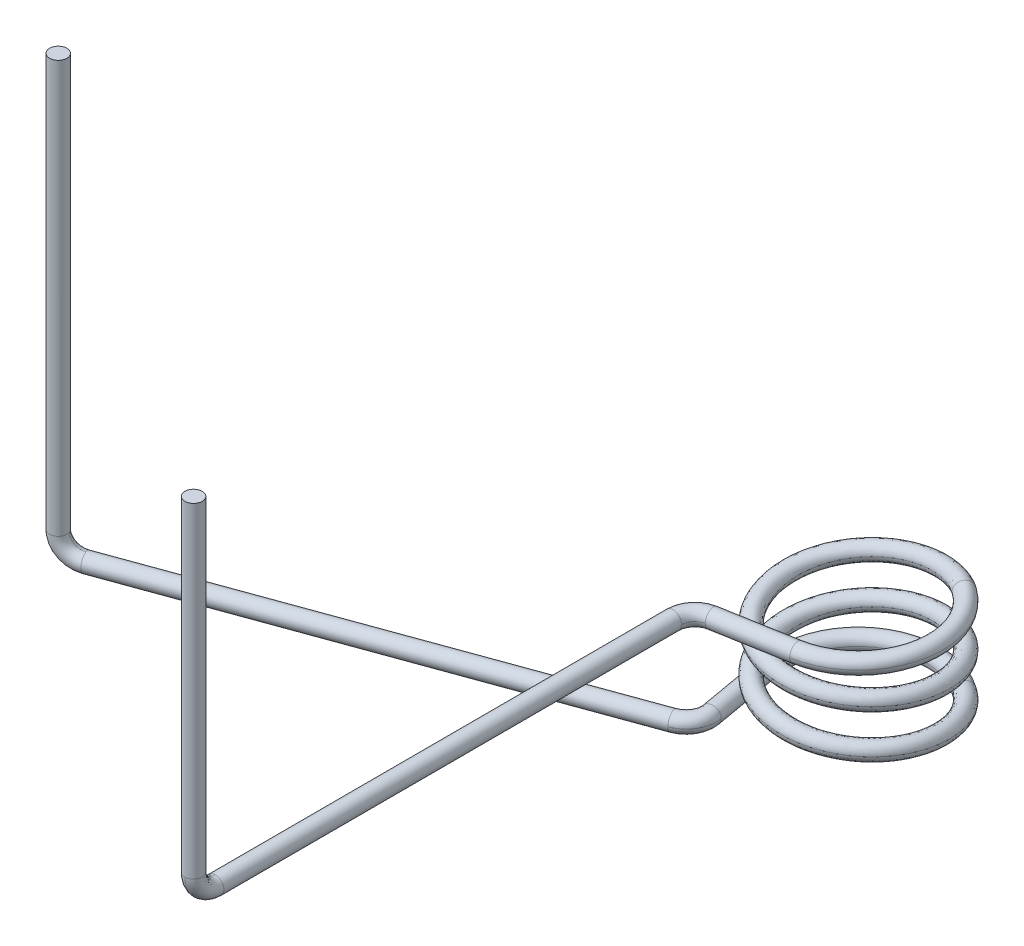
ISO-10303-21;
HEADER;
FILE_DESCRIPTION(('STEP AP214'),'2;1');
FILE_NAME('part.step','',(''),(''),'','','');
FILE_SCHEMA(('AUTOMOTIVE_DESIGN { 1 0 10303 214 1 1 1 1 }'));
ENDSEC;
DATA;
#1=APPLICATION_CONTEXT('core data for automotive mechanical design processes');
#2=APPLICATION_PROTOCOL_DEFINITION('international standard','automotive_design',2000,#1);
#3=PRODUCT_CONTEXT('',#1,'mechanical');
#4=PRODUCT('Part','Part','',(#3));
#5=PRODUCT_RELATED_PRODUCT_CATEGORY('part','',(#4));
#6=PRODUCT_DEFINITION_FORMATION('','',#4);
#7=PRODUCT_DEFINITION_CONTEXT('part definition',#1,'design');
#8=PRODUCT_DEFINITION('design','',#6,#7);
#9=PRODUCT_DEFINITION_SHAPE('','',#8);
#10=(LENGTH_UNIT() NAMED_UNIT(*) SI_UNIT(.MILLI.,.METRE.));
#11=(NAMED_UNIT(*) PLANE_ANGLE_UNIT() SI_UNIT($,.RADIAN.));
#12=(NAMED_UNIT(*) SI_UNIT($,.STERADIAN.) SOLID_ANGLE_UNIT());
#13=UNCERTAINTY_MEASURE_WITH_UNIT(LENGTH_MEASURE(1.E-05),#10,'distance_accuracy_value','');
#14=(GEOMETRIC_REPRESENTATION_CONTEXT(3) GLOBAL_UNCERTAINTY_ASSIGNED_CONTEXT((#13)) GLOBAL_UNIT_ASSIGNED_CONTEXT((#10,
#11,#12)) REPRESENTATION_CONTEXT('',''));
#15=CARTESIAN_POINT('',(0.,0.,0.));
#16=DIRECTION('',(0.,0.,1.));
#17=DIRECTION('',(1.,0.,0.));
#18=AXIS2_PLACEMENT_3D('',#15,#16,#17);
#19=CARTESIAN_POINT('',(-0.9905608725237,-1.07,73.8689232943));
#20=DIRECTION('',(0.,1.,0.));
#21=DIRECTION('',(0.00122173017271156,0.,0.999999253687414));
#22=AXIS2_PLACEMENT_3D('',#19,#20,#21);
#23=PLANE('',#22);
#24=CARTESIAN_POINT('',(-0.8751279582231,-1.07,73.98407449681));
#25=DIRECTION('',(0.,1.,0.));
#26=DIRECTION('',(0.,0.,1.));
#27=AXIS2_PLACEMENT_3D('',#24,#25,#26);
#28=CIRCLE('',#27,0.100000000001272);
#29=CARTESIAN_POINT('',(-0.8751279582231,-1.07,74.0840744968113));
#30=VERTEX_POINT('',#29);
#31=EDGE_CURVE('E20',#30,#30,#28,.T.);
#32=ORIENTED_EDGE('',*,*,#31,.T.);
#33=EDGE_LOOP('',(#32));
#34=FACE_BOUND('',#33,.T.);
#35=ADVANCED_FACE('F16',(#34),#23,.T.);
#36=CARTESIAN_POINT('',(-6.144720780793,-1.07,70.49032853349));
#37=DIRECTION('',(0.,1.,0.));
#38=DIRECTION('',(0.940109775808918,0.,-0.34087183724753));
#39=AXIS2_PLACEMENT_3D('',#36,#37,#38);
#40=PLANE('',#39);
#41=CARTESIAN_POINT('',(-6.075633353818,-1.07,70.34264141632));
#42=DIRECTION('',(0.,1.,0.));
#43=DIRECTION('',(0.,0.,1.));
#44=AXIS2_PLACEMENT_3D('',#41,#42,#43);
#45=CIRCLE('',#44,0.100000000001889);
#46=CARTESIAN_POINT('',(-6.075633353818,-1.07,70.4426414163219));
#47=VERTEX_POINT('',#46);
#48=EDGE_CURVE('E111',#47,#47,#45,.T.);
#49=ORIENTED_EDGE('',*,*,#48,.T.);
#50=EDGE_LOOP('',(#49));
#51=FACE_BOUND('',#50,.T.);
#52=ADVANCED_FACE('F18',(#51),#40,.T.);
#53=CARTESIAN_POINT('',(-0.8751279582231,-4.82,73.98407449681));
#54=DIRECTION('',(0.,1.,0.));
#55=DIRECTION('',(0.,0.,1.));
#56=AXIS2_PLACEMENT_3D('',#53,#54,#55);
#57=CYLINDRICAL_SURFACE('',#56,0.100000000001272);
#58=ORIENTED_EDGE('',*,*,#31,.F.);
#59=EDGE_LOOP('',(#58));
#60=FACE_BOUND('',#59,.T.);
#61=CARTESIAN_POINT('',(-0.8751279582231,-4.82,73.98407449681));
#62=DIRECTION('',(0.,1.,0.));
#63=DIRECTION('',(0.0012217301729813,0.,0.999999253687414));
#64=AXIS2_PLACEMENT_3D('',#61,#62,#63);
#65=CIRCLE('',#64,0.100000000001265);
#66=CARTESIAN_POINT('',(-0.8752501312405,-4.82000000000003,73.8840745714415));
#67=VERTEX_POINT('',#66);
#68=CARTESIAN_POINT('',(-0.875005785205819,-4.81999999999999,74.0840744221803));
#69=VERTEX_POINT('',#68);
#70=EDGE_CURVE('E95',#67,#69,#65,.F.);
#71=ORIENTED_EDGE('',*,*,#70,.F.);
#72=CARTESIAN_POINT('',(-0.875127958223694,-4.82000000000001,73.9840744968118));
#73=DIRECTION('',(-2.16908621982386E-12,1.,-3.39319136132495E-13));
#74=DIRECTION('',(-1.,-2.16908621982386E-12,0.));
#75=AXIS2_PLACEMENT_3D('',#72,#73,#74);
#76=CIRCLE('',#75,0.100000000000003);
#77=EDGE_CURVE('E100',#67,#69,#76,.T.);
#78=ORIENTED_EDGE('',*,*,#77,.T.);
#79=EDGE_LOOP('',(#71,#78));
#80=FACE_BOUND('',#79,.T.);
#81=ADVANCED_FACE('F98',(#60,#80),#57,.T.);
#82=CARTESIAN_POINT('',(-6.075633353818,-5.82,70.34264141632));
#83=DIRECTION('',(0.,1.,0.));
#84=DIRECTION('',(0.,0.,1.));
#85=AXIS2_PLACEMENT_3D('',#82,#83,#84);
#86=CYLINDRICAL_SURFACE('',#85,0.100000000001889);
#87=ORIENTED_EDGE('',*,*,#48,.F.);
#88=EDGE_LOOP('',(#87));
#89=FACE_BOUND('',#88,.T.);
#90=CARTESIAN_POINT('',(-6.075633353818,-5.82,70.34264141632));
#91=DIRECTION('',(0.,1.,0.));
#92=DIRECTION('',(0.940109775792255,0.,-0.340871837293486));
#93=AXIS2_PLACEMENT_3D('',#90,#91,#92);
#94=CIRCLE('',#93,0.100000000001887);
#95=CARTESIAN_POINT('',(-6.16964433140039,-5.82,70.3767286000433));
#96=VERTEX_POINT('',#95);
#97=CARTESIAN_POINT('',(-5.98162237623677,-5.82,70.3085542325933));
#98=VERTEX_POINT('',#97);
#99=EDGE_CURVE('E102',#96,#98,#94,.F.);
#100=ORIENTED_EDGE('',*,*,#99,.F.);
#101=CARTESIAN_POINT('',(-6.07563335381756,-5.82,70.342641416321));
#102=DIRECTION('',(0.,1.,0.));
#103=DIRECTION('',(0.,0.,1.));
#104=AXIS2_PLACEMENT_3D('',#101,#102,#103);
#105=CIRCLE('',#104,0.10000000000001);
#106=EDGE_CURVE('E388',#96,#98,#105,.T.);
#107=ORIENTED_EDGE('',*,*,#106,.T.);
#108=EDGE_LOOP('',(#100,#107));
#109=FACE_BOUND('',#108,.T.);
#110=ADVANCED_FACE('F135',(#89,#109),#86,.T.);
#111=CARTESIAN_POINT('',(-5.83541354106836,-5.47116697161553,70.2717437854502));
#112=CARTESIAN_POINT('',(-5.85763027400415,-5.46112170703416,70.2104709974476));
#113=CARTESIAN_POINT('',(-5.87469309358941,-5.50405422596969,70.163412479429));
#114=CARTESIAN_POINT('',(-5.87469309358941,-5.56999999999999,70.163412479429));
#115=CARTESIAN_POINT('',(-5.87469309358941,-5.6359457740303,70.163412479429));
#116=CARTESIAN_POINT('',(-5.85763027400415,-5.67887829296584,70.2104709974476));
#117=CARTESIAN_POINT('',(-5.83541354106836,-5.66883302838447,70.2717437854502));
#118=(BOUNDED_CURVE() B_SPLINE_CURVE(3,(#111,#112,#113,#114,#115,#116,#117),.UNSPECIFIED.,.F.,
.F.) B_SPLINE_CURVE_WITH_KNOTS((4,3,4),(0.,0.5,1.),
.UNSPECIFIED.) CURVE() GEOMETRIC_REPRESENTATION_ITEM() RATIONAL_B_SPLINE_CURVE((1.,
0.767351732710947,0.767351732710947,1.,0.767351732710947,0.767351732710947,1.)) REPRESENTATION_ITEM(''));
#119=CARTESIAN_POINT('',(-5.840605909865,-5.82,70.25742345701));
#120=DIRECTION('',(-0.340871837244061,0.,-0.940109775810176));
#121=AXIS1_PLACEMENT('',#119,#120);
#122=SURFACE_OF_REVOLUTION('',#118,#121);
#123=ORIENTED_EDGE('',*,*,#99,.T.);
#124=CARTESIAN_POINT('',(-5.840605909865,-5.82,70.25742345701));
#125=DIRECTION('',(-0.340871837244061,0.,-0.940109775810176));
#126=DIRECTION('',(0.,1.,0.));
#127=AXIS2_PLACEMENT_3D('',#124,#125,#126);
#128=CIRCLE('',#127,0.150000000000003);
#129=CARTESIAN_POINT('',(-5.840605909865,-5.96999999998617,70.25742345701));
#130=VERTEX_POINT('',#129);
#131=EDGE_CURVE('E382',#98,#130,#128,.F.);
#132=ORIENTED_EDGE('',*,*,#131,.T.);
#133=CARTESIAN_POINT('',(-5.84060590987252,-6.07,70.2574234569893));
#134=DIRECTION('',(-0.940109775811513,0.,0.340871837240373));
#135=DIRECTION('',(0.340871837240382,0.,0.940109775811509));
#136=AXIS2_PLACEMENT_3D('',#133,#134,#135);
#137=CIRCLE('',#136,0.100000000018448);
#138=CARTESIAN_POINT('',(-5.84060590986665,-6.17000000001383,70.2574234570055));
#139=VERTEX_POINT('',#138);
#140=EDGE_CURVE('E387',#130,#139,#137,.T.);
#141=ORIENTED_EDGE('',*,*,#140,.T.);
#142=CARTESIAN_POINT('',(-5.840605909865,-5.82,70.25742345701));
#143=DIRECTION('',(-0.340871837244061,0.,-0.940109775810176));
#144=DIRECTION('',(0.,1.,0.));
#145=AXIS2_PLACEMENT_3D('',#142,#143,#144);
#146=CIRCLE('',#145,0.349999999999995);
#147=EDGE_CURVE('E391',#139,#96,#146,.T.);
#148=ORIENTED_EDGE('',*,*,#147,.T.);
#149=EDGE_LOOP('',(#123,#132,#141,#148));
#150=FACE_BOUND('',#149,.T.);
#151=ADVANCED_FACE('F142',(#150),#122,.T.);
#152=CARTESIAN_POINT('',(-0.89066599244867,-4.66883302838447,73.734093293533));
#153=CARTESIAN_POINT('',(-0.825489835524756,-4.67887829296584,73.7340136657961));
#154=CARTESIAN_POINT('',(-0.775433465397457,-4.63594577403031,73.7339525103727));
#155=CARTESIAN_POINT('',(-0.77543346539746,-4.56999999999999,73.7339525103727));
#156=CARTESIAN_POINT('',(-0.775433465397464,-4.50405422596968,73.7339525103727));
#157=CARTESIAN_POINT('',(-0.825489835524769,-4.46112170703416,73.7340136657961));
#158=CARTESIAN_POINT('',(-0.890665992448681,-4.47116697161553,73.734093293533));
#159=(BOUNDED_CURVE() B_SPLINE_CURVE(3,(#152,#153,#154,#155,#156,#157,#158),.UNSPECIFIED.,.F.,
.F.) B_SPLINE_CURVE_WITH_KNOTS((4,3,4),(0.,0.5,1.),
.UNSPECIFIED.) CURVE() GEOMETRIC_REPRESENTATION_ITEM() RATIONAL_B_SPLINE_CURVE((1.,
0.767351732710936,0.767351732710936,1.,0.767351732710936,0.767351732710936,1.)) REPRESENTATION_ITEM(''));
#160=CARTESIAN_POINT('',(-0.8754333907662,-4.82,73.73407468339));
#161=DIRECTION('',(-0.999999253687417,0.,0.00122173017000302));
#162=AXIS1_PLACEMENT('',#160,#161);
#163=SURFACE_OF_REVOLUTION('',#159,#162);
#164=ORIENTED_EDGE('',*,*,#70,.T.);
#165=CARTESIAN_POINT('',(-0.875433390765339,-4.82,73.73407468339));
#166=DIRECTION('',(-0.999999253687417,0.,0.00122173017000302));
#167=DIRECTION('',(0.,1.,0.));
#168=AXIS2_PLACEMENT_3D('',#165,#166,#167);
#169=CIRCLE('',#168,0.349999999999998);
#170=CARTESIAN_POINT('',(-0.875433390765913,-5.16999999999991,73.73407468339));
#171=VERTEX_POINT('',#170);
#172=EDGE_CURVE('E114',#69,#171,#169,.F.);
#173=ORIENTED_EDGE('',*,*,#172,.T.);
#174=CARTESIAN_POINT('',(-0.875433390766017,-5.07,73.73407468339));
#175=DIRECTION('',(0.0012217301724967,0.,0.999999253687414));
#176=DIRECTION('',(0.999999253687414,0.,-0.00122173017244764));
#177=AXIS2_PLACEMENT_3D('',#174,#175,#176);
#178=CIRCLE('',#177,0.0999999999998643);
#179=CARTESIAN_POINT('',(-0.875433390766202,-4.97000000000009,73.73407468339));
#180=VERTEX_POINT('',#179);
#181=EDGE_CURVE('E107',#171,#180,#178,.T.);
#182=ORIENTED_EDGE('',*,*,#181,.T.);
#183=CARTESIAN_POINT('',(-0.8754333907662,-4.82,73.73407468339));
#184=DIRECTION('',(-0.999999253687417,0.,0.00122173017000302));
#185=DIRECTION('',(0.,1.,0.));
#186=AXIS2_PLACEMENT_3D('',#183,#184,#185);
#187=CIRCLE('',#186,0.150000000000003);
#188=EDGE_CURVE('E105',#180,#67,#187,.T.);
#189=ORIENTED_EDGE('',*,*,#188,.T.);
#190=EDGE_LOOP('',(#164,#173,#182,#189));
#191=FACE_BOUND('',#190,.T.);
#192=ADVANCED_FACE('F106',(#191),#163,.T.);
#193=CARTESIAN_POINT('',(-0.86020078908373,-4.47116697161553,73.734056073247));
#194=CARTESIAN_POINT('',(-0.925376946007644,-4.46112170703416,73.7341357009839));
#195=CARTESIAN_POINT('',(-0.975433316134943,-4.50405422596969,73.7341968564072));
#196=CARTESIAN_POINT('',(-0.975433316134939,-4.57000000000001,73.7341968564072));
#197=CARTESIAN_POINT('',(-0.975433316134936,-4.63594577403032,73.7341968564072));
#198=CARTESIAN_POINT('',(-0.925376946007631,-4.67887829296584,73.7341357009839));
#199=CARTESIAN_POINT('',(-0.860200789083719,-4.66883302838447,73.734056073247));
#200=(BOUNDED_CURVE() B_SPLINE_CURVE(3,(#193,#194,#195,#196,#197,#198,#199),.UNSPECIFIED.,.F.,
.F.) B_SPLINE_CURVE_WITH_KNOTS((4,3,4),(0.,0.5,1.),
.UNSPECIFIED.) CURVE() GEOMETRIC_REPRESENTATION_ITEM() RATIONAL_B_SPLINE_CURVE((1.,
0.767351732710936,0.767351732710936,1.,0.767351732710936,0.767351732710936,1.)) REPRESENTATION_ITEM(''));
#201=CARTESIAN_POINT('',(-0.8754333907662,-4.82,73.73407468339));
#202=DIRECTION('',(-0.999999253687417,0.,0.00122173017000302));
#203=AXIS1_PLACEMENT('',#201,#202);
#204=SURFACE_OF_REVOLUTION('',#200,#203);
#205=ORIENTED_EDGE('',*,*,#77,.F.);
#206=ORIENTED_EDGE('',*,*,#188,.F.);
#207=CARTESIAN_POINT('',(-0.875433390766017,-5.07,73.73407468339));
#208=DIRECTION('',(0.0012217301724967,0.,0.999999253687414));
#209=DIRECTION('',(0.999999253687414,0.,-0.00122173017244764));
#210=AXIS2_PLACEMENT_3D('',#207,#208,#209);
#211=CIRCLE('',#210,0.0999999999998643);
#212=EDGE_CURVE('E400',#180,#171,#211,.T.);
#213=ORIENTED_EDGE('',*,*,#212,.T.);
#214=ORIENTED_EDGE('',*,*,#172,.F.);
#215=EDGE_LOOP('',(#205,#206,#213,#214));
#216=FACE_BOUND('',#215,.T.);
#217=ADVANCED_FACE('F113',(#216),#204,.T.);
#218=CARTESIAN_POINT('',(-5.84579827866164,-5.66883302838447,70.2431031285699));
#219=CARTESIAN_POINT('',(-5.82358154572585,-5.67887829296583,70.3043759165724));
#220=CARTESIAN_POINT('',(-5.80651872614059,-5.6359457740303,70.351434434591));
#221=CARTESIAN_POINT('',(-5.80651872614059,-5.56999999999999,70.351434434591));
#222=CARTESIAN_POINT('',(-5.80651872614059,-5.50405422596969,70.351434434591));
#223=CARTESIAN_POINT('',(-5.82358154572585,-5.46112170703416,70.3043759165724));
#224=CARTESIAN_POINT('',(-5.84579827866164,-5.47116697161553,70.2431031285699));
#225=(BOUNDED_CURVE() B_SPLINE_CURVE(3,(#218,#219,#220,#221,#222,#223,#224),.UNSPECIFIED.,.F.,
.F.) B_SPLINE_CURVE_WITH_KNOTS((4,3,4),(0.,0.5,1.),
.UNSPECIFIED.) CURVE() GEOMETRIC_REPRESENTATION_ITEM() RATIONAL_B_SPLINE_CURVE((1.,
0.767351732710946,0.767351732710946,1.,0.767351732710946,0.767351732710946,1.)) REPRESENTATION_ITEM(''));
#226=CARTESIAN_POINT('',(-5.840605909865,-5.82,70.25742345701));
#227=DIRECTION('',(-0.340871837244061,0.,-0.940109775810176));
#228=AXIS1_PLACEMENT('',#226,#227);
#229=SURFACE_OF_REVOLUTION('',#225,#228);
#230=ORIENTED_EDGE('',*,*,#106,.F.);
#231=ORIENTED_EDGE('',*,*,#147,.F.);
#232=CARTESIAN_POINT('',(-5.84060590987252,-6.07,70.2574234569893));
#233=DIRECTION('',(-0.940109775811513,0.,0.340871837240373));
#234=DIRECTION('',(0.340871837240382,0.,0.940109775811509));
#235=AXIS2_PLACEMENT_3D('',#232,#233,#234);
#236=CIRCLE('',#235,0.100000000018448);
#237=EDGE_CURVE('E405',#139,#130,#236,.T.);
#238=ORIENTED_EDGE('',*,*,#237,.T.);
#239=ORIENTED_EDGE('',*,*,#131,.F.);
#240=EDGE_LOOP('',(#230,#231,#238,#239));
#241=FACE_BOUND('',#240,.T.);
#242=ADVANCED_FACE('F367',(#241),#229,.T.);
#243=CARTESIAN_POINT('',(-0.8818841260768,-5.07,68.45407862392));
#244=DIRECTION('',(0.00122173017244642,0.,0.999999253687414));
#245=DIRECTION('',(0.999999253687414,0.,-0.00122173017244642));
#246=AXIS2_PLACEMENT_3D('',#243,#244,#245);
#247=CYLINDRICAL_SURFACE('',#246,0.100000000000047);
#248=CARTESIAN_POINT('',(-0.881884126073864,-5.06999999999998,68.4540786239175));
#249=DIRECTION('',(0.00122173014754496,-1.20039898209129E-13,0.999999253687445));
#250=DIRECTION('',(0.999999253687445,0.,-0.00122173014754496));
#251=AXIS2_PLACEMENT_3D('',#248,#249,#250);
#252=CIRCLE('',#251,0.0999999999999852);
#253=CARTESIAN_POINT('',(-0.781884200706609,-5.07,68.4539564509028));
#254=VERTEX_POINT('',#253);
#255=CARTESIAN_POINT('',(-0.981884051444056,-5.07,68.4542007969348));
#256=VERTEX_POINT('',#255);
#257=EDGE_CURVE('E355',#254,#256,#252,.T.);
#258=ORIENTED_EDGE('',*,*,#257,.T.);
#259=CARTESIAN_POINT('',(-0.8818841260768,-5.07,68.45407862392));
#260=DIRECTION('',(0.0012217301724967,0.,0.999999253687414));
#261=DIRECTION('',(0.999999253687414,0.,-0.00122173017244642));
#262=AXIS2_PLACEMENT_3D('',#259,#260,#261);
#263=CIRCLE('',#262,0.0999999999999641);
#264=EDGE_CURVE('E116',#254,#256,#263,.F.);
#265=ORIENTED_EDGE('',*,*,#264,.F.);
#266=EDGE_LOOP('',(#258,#265));
#267=FACE_BOUND('',#266,.T.);
#268=ORIENTED_EDGE('',*,*,#181,.F.);
#269=ORIENTED_EDGE('',*,*,#212,.F.);
#270=EDGE_LOOP('',(#268,#269));
#271=FACE_BOUND('',#270,.T.);
#272=ADVANCED_FACE('F363',(#267,#271),#247,.T.);
#273=CARTESIAN_POINT('',(-0.605634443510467,-5.05476738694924,68.6026435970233));
#274=CARTESIAN_POINT('',(-0.607378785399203,-5.11994359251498,68.5927509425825));
#275=CARTESIAN_POINT('',(-0.599923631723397,-5.17000000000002,68.6350312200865));
#276=CARTESIAN_POINT('',(-0.588472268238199,-5.17000000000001,68.69997512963));
#277=CARTESIAN_POINT('',(-0.577020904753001,-5.17000000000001,68.7649190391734));
#278=CARTESIAN_POINT('',(-0.569565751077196,-5.11994359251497,68.8071993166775));
#279=CARTESIAN_POINT('',(-0.571310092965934,-5.05476738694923,68.7973066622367));
#280=(BOUNDED_CURVE() B_SPLINE_CURVE(3,(#273,#274,#275,#276,#277,#278,#279),.UNSPECIFIED.,.F.,
.F.) B_SPLINE_CURVE_WITH_KNOTS((4,3,4),(0.,0.5,1.),
.UNSPECIFIED.) CURVE() GEOMETRIC_REPRESENTATION_ITEM() RATIONAL_B_SPLINE_CURVE((1.,
0.767351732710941,0.767351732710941,1.,0.767351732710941,0.767351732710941,1.)) REPRESENTATION_ITEM(''));
#281=CARTESIAN_POINT('',(-0.631884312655,-5.07,68.45377319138));
#282=DIRECTION('',(0.,1.,0.));
#283=AXIS1_PLACEMENT('',#281,#282);
#284=SURFACE_OF_REVOLUTION('',#280,#283);
#285=ORIENTED_EDGE('',*,*,#264,.T.);
#286=CARTESIAN_POINT('',(-0.631884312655,-5.07,68.45377319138));
#287=DIRECTION('',(0.,1.,0.));
#288=DIRECTION('',(0.173648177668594,0.,0.984807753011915));
#289=AXIS2_PLACEMENT_3D('',#286,#287,#288);
#290=CIRCLE('',#289,0.349999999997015);
#291=CARTESIAN_POINT('',(-0.692661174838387,-5.07,68.1090904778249));
#292=VERTEX_POINT('',#291);
#293=EDGE_CURVE('E304',#256,#292,#290,.F.);
#294=ORIENTED_EDGE('',*,*,#293,.T.);
#295=CARTESIAN_POINT('',(-0.675296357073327,-5.07,68.2075712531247));
#296=DIRECTION('',(-0.984807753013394,0.,0.173648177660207));
#297=DIRECTION('',(0.173648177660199,0.,0.984807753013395));
#298=AXIS2_PLACEMENT_3D('',#295,#296,#297);
#299=CIRCLE('',#298,0.0999999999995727);
#300=CARTESIAN_POINT('',(-0.657931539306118,-5.07,68.3060520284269));
#301=VERTEX_POINT('',#300);
#302=EDGE_CURVE('E296',#292,#301,#299,.T.);
#303=ORIENTED_EDGE('',*,*,#302,.T.);
#304=CARTESIAN_POINT('',(-0.631884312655,-5.07,68.45377319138));
#305=DIRECTION('',(0.,1.,0.));
#306=DIRECTION('',(0.173648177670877,0.,0.984807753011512));
#307=AXIS2_PLACEMENT_3D('',#304,#305,#306);
#308=CIRCLE('',#307,0.149999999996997);
#309=EDGE_CURVE('E442',#301,#254,#308,.T.);
#310=ORIENTED_EDGE('',*,*,#309,.T.);
#311=EDGE_LOOP('',(#285,#294,#303,#310));
#312=FACE_BOUND('',#311,.T.);
#313=ADVANCED_FACE('F360',(#312),#284,.T.);
#314=CARTESIAN_POINT('',(-0.876826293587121,-6.07,68.4576201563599));
#315=DIRECTION('',(-0.940109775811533,0.,0.340871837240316));
#316=DIRECTION('',(0.340871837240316,0.,0.940109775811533));
#317=AXIS2_PLACEMENT_3D('',#314,#315,#316);
#318=CYLINDRICAL_SURFACE('',#317,0.100000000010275);
#319=ORIENTED_EDGE('',*,*,#237,.F.);
#320=ORIENTED_EDGE('',*,*,#140,.F.);
#321=EDGE_LOOP('',(#319,#320));
#322=FACE_BOUND('',#321,.T.);
#323=CARTESIAN_POINT('',(-0.876826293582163,-6.06999999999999,68.4576201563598));
#324=DIRECTION('',(-0.940109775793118,0.,0.340871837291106));
#325=DIRECTION('',(0.340871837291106,0.,0.940109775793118));
#326=AXIS2_PLACEMENT_3D('',#323,#324,#325);
#327=CIRCLE('',#326,0.100000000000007);
#328=CARTESIAN_POINT('',(-0.910913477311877,-6.07,68.3636091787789));
#329=VERTEX_POINT('',#328);
#330=CARTESIAN_POINT('',(-0.842739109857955,-6.07,68.551631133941));
#331=VERTEX_POINT('',#330);
#332=EDGE_CURVE('E342',#329,#331,#327,.T.);
#333=ORIENTED_EDGE('',*,*,#332,.T.);
#334=CARTESIAN_POINT('',(-0.876826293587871,-6.07,68.4576201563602));
#335=DIRECTION('',(-0.940109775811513,0.,0.340871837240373));
#336=DIRECTION('',(0.340871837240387,0.,0.940109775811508));
#337=AXIS2_PLACEMENT_3D('',#334,#335,#336);
#338=CIRCLE('',#337,0.100000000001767);
#339=EDGE_CURVE('E401',#329,#331,#338,.F.);
#340=ORIENTED_EDGE('',*,*,#339,.F.);
#341=EDGE_LOOP('',(#333,#340));
#342=FACE_BOUND('',#341,.T.);
#343=ADVANCED_FACE('F332',(#322,#342),#318,.T.);
#344=CARTESIAN_POINT('',(-1.1109146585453,-6.08523261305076,68.2488425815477));
#345=CARTESIAN_POINT('',(-1.10102200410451,-6.02005640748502,68.247098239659));
#346=CARTESIAN_POINT('',(-1.14330228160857,-5.97,68.2545533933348));
#347=CARTESIAN_POINT('',(-1.20824619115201,-5.97,68.26600475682));
#348=CARTESIAN_POINT('',(-1.27319010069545,-5.97000000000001,68.2774561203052));
#349=CARTESIAN_POINT('',(-1.31547037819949,-6.02005640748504,68.284911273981));
#350=CARTESIAN_POINT('',(-1.3055777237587,-6.08523261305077,68.2831669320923));
#351=(BOUNDED_CURVE() B_SPLINE_CURVE(3,(#344,#345,#346,#347,#348,#349,#350),.UNSPECIFIED.,.F.,
.F.) B_SPLINE_CURVE_WITH_KNOTS((4,3,4),(0.,0.5,1.),
.UNSPECIFIED.) CURVE() GEOMETRIC_REPRESENTATION_ITEM() RATIONAL_B_SPLINE_CURVE((1.,
0.767351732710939,0.767351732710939,1.,0.767351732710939,0.767351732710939,1.)) REPRESENTATION_ITEM(''));
#352=CARTESIAN_POINT('',(-0.9620442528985,-6.07,68.22259271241));
#353=DIRECTION('',(0.,-1.,0.));
#354=AXIS1_PLACEMENT('',#352,#353);
#355=SURFACE_OF_REVOLUTION('',#351,#354);
#356=ORIENTED_EDGE('',*,*,#339,.T.);
#357=CARTESIAN_POINT('',(-0.9620442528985,-6.07,68.22259271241));
#358=DIRECTION('',(0.,-1.,0.));
#359=DIRECTION('',(-0.984807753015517,0.,0.173648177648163));
#360=AXIS2_PLACEMENT_3D('',#357,#358,#359);
#361=CIRCLE('',#360,0.349999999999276);
#362=CARTESIAN_POINT('',(-0.617361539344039,-6.07,68.1618158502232));
#363=VERTEX_POINT('',#362);
#364=EDGE_CURVE('E348',#331,#363,#361,.F.);
#365=ORIENTED_EDGE('',*,*,#364,.T.);
#366=CARTESIAN_POINT('',(-0.715842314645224,-6.07,68.17918066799));
#367=DIRECTION('',(0.173648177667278,0.,0.984807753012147));
#368=DIRECTION('',(0.984807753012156,0.,-0.173648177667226));
#369=AXIS2_PLACEMENT_3D('',#366,#367,#368);
#370=CIRCLE('',#369,0.100000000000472);
#371=CARTESIAN_POINT('',(-0.814323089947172,-6.07,68.1965454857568));
#372=VERTEX_POINT('',#371);
#373=EDGE_CURVE('E310',#363,#372,#370,.T.);
#374=ORIENTED_EDGE('',*,*,#373,.T.);
#375=CARTESIAN_POINT('',(-0.9620442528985,-6.07,68.22259271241));
#376=DIRECTION('',(0.,-1.,0.));
#377=DIRECTION('',(-0.984807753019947,0.,0.173648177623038));
#378=AXIS2_PLACEMENT_3D('',#375,#376,#377);
#379=CIRCLE('',#378,0.149999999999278);
#380=EDGE_CURVE('E303',#372,#329,#379,.T.);
#381=ORIENTED_EDGE('',*,*,#380,.T.);
#382=EDGE_LOOP('',(#356,#365,#374,#381));
#383=FACE_BOUND('',#382,.T.);
#384=ADVANCED_FACE('F326',(#383),#355,.T.);
#385=CARTESIAN_POINT('',(-0.571310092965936,-5.08523261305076,68.7973066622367));
#386=CARTESIAN_POINT('',(-0.5695657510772,-5.02005640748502,68.8071993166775));
#387=CARTESIAN_POINT('',(-0.577020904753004,-4.97,68.7649190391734));
#388=CARTESIAN_POINT('',(-0.588472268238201,-4.97,68.69997512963));
#389=CARTESIAN_POINT('',(-0.599923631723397,-4.97000000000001,68.6350312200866));
#390=CARTESIAN_POINT('',(-0.607378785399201,-5.02005640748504,68.5927509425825));
#391=CARTESIAN_POINT('',(-0.605634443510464,-5.08523261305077,68.6026435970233));
#392=(BOUNDED_CURVE() B_SPLINE_CURVE(3,(#385,#386,#387,#388,#389,#390,#391),.UNSPECIFIED.,.F.,
.F.) B_SPLINE_CURVE_WITH_KNOTS((4,3,4),(0.,0.5,1.),
.UNSPECIFIED.) CURVE() GEOMETRIC_REPRESENTATION_ITEM() RATIONAL_B_SPLINE_CURVE((1.,
0.767351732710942,0.767351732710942,1.,0.767351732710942,0.767351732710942,1.)) REPRESENTATION_ITEM(''));
#393=CARTESIAN_POINT('',(-0.631884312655,-5.07,68.45377319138));
#394=DIRECTION('',(0.,1.,0.));
#395=AXIS1_PLACEMENT('',#393,#394);
#396=SURFACE_OF_REVOLUTION('',#392,#395);
#397=ORIENTED_EDGE('',*,*,#257,.F.);
#398=ORIENTED_EDGE('',*,*,#309,.F.);
#399=CARTESIAN_POINT('',(-0.675296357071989,-5.07,68.2075712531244));
#400=DIRECTION('',(-0.984807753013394,0.,0.173648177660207));
#401=DIRECTION('',(0.173648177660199,0.,0.984807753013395));
#402=AXIS2_PLACEMENT_3D('',#399,#400,#401);
#403=CIRCLE('',#402,0.0999999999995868);
#404=EDGE_CURVE('E307',#301,#292,#403,.T.);
#405=ORIENTED_EDGE('',*,*,#404,.T.);
#406=ORIENTED_EDGE('',*,*,#293,.F.);
#407=EDGE_LOOP('',(#397,#398,#405,#406));
#408=FACE_BOUND('',#407,.T.);
#409=ADVANCED_FACE('F322',(#408),#396,.T.);
#410=CARTESIAN_POINT('',(-1.3055777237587,-6.05476738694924,68.2831669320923));
#411=CARTESIAN_POINT('',(-1.31547037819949,-6.11994359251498,68.284911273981));
#412=CARTESIAN_POINT('',(-1.27319010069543,-6.17,68.2774561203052));
#413=CARTESIAN_POINT('',(-1.20824619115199,-6.17,68.26600475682));
#414=CARTESIAN_POINT('',(-1.14330228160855,-6.16999999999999,68.2545533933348));
#415=CARTESIAN_POINT('',(-1.10102200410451,-6.11994359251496,68.247098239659));
#416=CARTESIAN_POINT('',(-1.1109146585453,-6.05476738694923,68.2488425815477));
#417=(BOUNDED_CURVE() B_SPLINE_CURVE(3,(#410,#411,#412,#413,#414,#415,#416),.UNSPECIFIED.,.F.,
.F.) B_SPLINE_CURVE_WITH_KNOTS((4,3,4),(0.,0.5,1.),
.UNSPECIFIED.) CURVE() GEOMETRIC_REPRESENTATION_ITEM() RATIONAL_B_SPLINE_CURVE((1.,
0.767351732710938,0.767351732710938,1.,0.767351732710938,0.767351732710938,1.)) REPRESENTATION_ITEM(''));
#418=CARTESIAN_POINT('',(-0.9620442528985,-6.07,68.22259271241));
#419=DIRECTION('',(0.,-1.,0.));
#420=AXIS1_PLACEMENT('',#418,#419);
#421=SURFACE_OF_REVOLUTION('',#417,#420);
#422=ORIENTED_EDGE('',*,*,#332,.F.);
#423=ORIENTED_EDGE('',*,*,#380,.F.);
#424=CARTESIAN_POINT('',(-0.715842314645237,-6.07,68.1791806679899));
#425=DIRECTION('',(0.173648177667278,0.,0.984807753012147));
#426=DIRECTION('',(0.984807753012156,0.,-0.173648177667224));
#427=AXIS2_PLACEMENT_3D('',#424,#425,#426);
#428=CIRCLE('',#427,0.100000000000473);
#429=EDGE_CURVE('E458',#372,#363,#428,.T.);
#430=ORIENTED_EDGE('',*,*,#429,.T.);
#431=ORIENTED_EDGE('',*,*,#364,.F.);
#432=EDGE_LOOP('',(#422,#423,#430,#431));
#433=FACE_BOUND('',#432,.T.);
#434=ADVANCED_FACE('F325',(#433),#421,.T.);
#435=CARTESIAN_POINT('',(0.151942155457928,-5.07,68.0617067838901));
#436=DIRECTION('',(-0.984807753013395,0.,0.173648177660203));
#437=DIRECTION('',(0.173648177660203,0.,0.984807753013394));
#438=AXIS2_PLACEMENT_3D('',#435,#436,#437);
#439=CYLINDRICAL_SURFACE('',#438,0.0999999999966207);
#440=ORIENTED_EDGE('',*,*,#404,.F.);
#441=ORIENTED_EDGE('',*,*,#302,.F.);
#442=EDGE_LOOP('',(#440,#441));
#443=FACE_BOUND('',#442,.T.);
#444=CARTESIAN_POINT('',(0.151942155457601,-5.06999999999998,68.0617067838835));
#445=DIRECTION('',(-0.984807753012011,0.,0.173648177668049));
#446=DIRECTION('',(0.173648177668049,0.,0.984807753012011));
#447=AXIS2_PLACEMENT_3D('',#444,#445,#446);
#448=CIRCLE('',#447,0.100000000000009);
#449=CARTESIAN_POINT('',(0.134577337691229,-5.07,67.9632260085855));
#450=VERTEX_POINT('',#449);
#451=CARTESIAN_POINT('',(0.169306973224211,-5.07,68.1601875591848));
#452=VERTEX_POINT('',#451);
#453=EDGE_CURVE('E269',#450,#452,#448,.T.);
#454=ORIENTED_EDGE('',*,*,#453,.T.);
#455=CARTESIAN_POINT('',(0.151942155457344,-5.06999999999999,68.0617067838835));
#456=DIRECTION('',(-0.984807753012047,0.,0.173648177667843));
#457=DIRECTION('',(0.173648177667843,0.,0.984807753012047));
#458=AXIS2_PLACEMENT_3D('',#455,#456,#457);
#459=CIRCLE('',#458,0.0999999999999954);
#460=EDGE_CURVE('E510',#452,#450,#459,.T.);
#461=ORIENTED_EDGE('',*,*,#460,.T.);
#462=EDGE_LOOP('',(#454,#461));
#463=FACE_BOUND('',#462,.T.);
#464=ADVANCED_FACE('F281',(#443,#463),#439,.T.);
#465=CARTESIAN_POINT('',(-0.558567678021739,-5.05476738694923,67.9977173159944));
#466=CARTESIAN_POINT('',(-0.564329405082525,-5.11994359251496,68.0059459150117));
#467=CARTESIAN_POINT('',(-0.539704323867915,-5.16999999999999,67.9707776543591));
#468=CARTESIAN_POINT('',(-0.501879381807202,-5.16999999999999,67.91675803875));
#469=CARTESIAN_POINT('',(-0.46405443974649,-5.17,67.8627384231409));
#470=CARTESIAN_POINT('',(-0.439429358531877,-5.11994359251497,67.8275701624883));
#471=CARTESIAN_POINT('',(-0.44519108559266,-5.05476738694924,67.8357987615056));
#472=(BOUNDED_CURVE() B_SPLINE_CURVE(3,(#465,#466,#467,#468,#469,#470,#471),.UNSPECIFIED.,.F.,
.F.) B_SPLINE_CURVE_WITH_KNOTS((4,3,4),(0.,0.5,1.),
.UNSPECIFIED.) CURVE() GEOMETRIC_REPRESENTATION_ITEM() RATIONAL_B_SPLINE_CURVE((1.,
0.767351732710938,0.767351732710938,1.,0.767351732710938,0.767351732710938,1.)) REPRESENTATION_ITEM(''));
#473=CARTESIAN_POINT('',(0.,-5.07,67.2));
#474=DIRECTION('',(0.,-1.,0.));
#475=AXIS1_PLACEMENT('',#473,#474);
#476=SURFACE_OF_REVOLUTION('',#472,#475);
#477=ORIENTED_EDGE('',*,*,#453,.F.);
#478=CARTESIAN_POINT('',(0.,-5.07,67.2));
#479=DIRECTION('',(0.,-1.,0.));
#480=DIRECTION('',(-0.573576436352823,0.,0.819152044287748));
#481=AXIS2_PLACEMENT_3D('',#478,#479,#480);
#482=CIRCLE('',#481,0.774999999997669);
#483=CARTESIAN_POINT('',(0.444507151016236,-5.06999971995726,66.565177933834));
#484=VERTEX_POINT('',#483);
#485=EDGE_CURVE('E257',#450,#484,#482,.F.);
#486=ORIENTED_EDGE('',*,*,#485,.T.);
#487=CARTESIAN_POINT('',(0.558522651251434,-5.0547650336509,66.4023469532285));
#488=CARTESIAN_POINT('',(0.558971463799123,-5.05980411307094,66.4017059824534));
#489=CARTESIAN_POINT('',(0.559983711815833,-5.08234725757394,66.4002603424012));
#490=CARTESIAN_POINT('',(0.553838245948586,-5.1223361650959,66.4090369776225));
#491=CARTESIAN_POINT('',(0.531863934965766,-5.16064971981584,66.4404195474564));
#492=CARTESIAN_POINT('',(0.501846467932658,-5.17467345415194,66.4832889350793));
#493=CARTESIAN_POINT('',(0.471829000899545,-5.16064971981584,66.5261583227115));
#494=CARTESIAN_POINT('',(0.449854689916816,-5.1223361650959,66.5575408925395));
#495=CARTESIAN_POINT('',(0.443709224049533,-5.08234725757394,66.5663175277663));
#496=CARTESIAN_POINT('',(0.444721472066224,-5.05980411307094,66.5648718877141));
#497=CARTESIAN_POINT('',(0.445170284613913,-5.0547650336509,66.5642309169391));
#498=B_SPLINE_CURVE_WITH_KNOTS('',3,(#487,#488,#489,#490,#491,#492,#493,#494,#495,#496,#497),
.UNSPECIFIED.,.F.,.F.,(4,1,1,1,1,1,1,1,4),(-0.02434870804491,0.,0.0833333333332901,
0.16666666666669,0.24999999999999,0.33333333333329,0.41666666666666,0.49999999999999,
0.5243487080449),.UNSPECIFIED.);
#499=CARTESIAN_POINT('',(0.559218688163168,-5.06999972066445,66.4013528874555));
#500=VERTEX_POINT('',#499);
#501=EDGE_CURVE('E34',#500,#484,#498,.T.);
#502=ORIENTED_EDGE('',*,*,#501,.F.);
#503=CARTESIAN_POINT('',(0.,-5.07,67.2));
#504=DIRECTION('',(0.,-1.,0.));
#505=DIRECTION('',(-0.573576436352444,0.,0.819152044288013));
#506=AXIS2_PLACEMENT_3D('',#503,#504,#505);
#507=CIRCLE('',#506,0.974999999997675);
#508=EDGE_CURVE('E509',#500,#452,#507,.T.);
#509=ORIENTED_EDGE('',*,*,#508,.T.);
#510=EDGE_LOOP('',(#477,#486,#502,#509));
#511=FACE_BOUND('',#510,.T.);
#512=ADVANCED_FACE('F275',(#511),#476,.T.);
#513=CARTESIAN_POINT('',(-0.861706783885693,-6.07,67.35194215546));
#514=DIRECTION('',(0.173648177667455,0.,0.984807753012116));
#515=DIRECTION('',(0.984807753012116,0.,-0.173648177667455));
#516=AXIS2_PLACEMENT_3D('',#513,#514,#515);
#517=CYLINDRICAL_SURFACE('',#516,0.10000000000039);
#518=ORIENTED_EDGE('',*,*,#429,.F.);
#519=ORIENTED_EDGE('',*,*,#373,.F.);
#520=EDGE_LOOP('',(#518,#519));
#521=FACE_BOUND('',#520,.T.);
#522=CARTESIAN_POINT('',(-0.861706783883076,-6.07000000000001,67.35194215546));
#523=DIRECTION('',(0.173648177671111,2.00953561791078E-13,0.984807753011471));
#524=DIRECTION('',(0.984807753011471,0.,-0.173648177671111));
#525=AXIS2_PLACEMENT_3D('',#522,#523,#524);
#526=CIRCLE('',#525,0.1);
#527=CARTESIAN_POINT('',(-0.763226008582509,-6.07,67.3345773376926));
#528=VERTEX_POINT('',#527);
#529=CARTESIAN_POINT('',(-0.960187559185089,-6.07,67.3693069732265));
#530=VERTEX_POINT('',#529);
#531=EDGE_CURVE('E505',#528,#530,#526,.T.);
#532=ORIENTED_EDGE('',*,*,#531,.T.);
#533=CARTESIAN_POINT('',(-0.861706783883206,-6.07,67.3519421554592));
#534=DIRECTION('',(0.173648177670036,0.,0.98480775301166));
#535=DIRECTION('',(0.984807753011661,0.,-0.173648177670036));
#536=AXIS2_PLACEMENT_3D('',#533,#534,#535);
#537=CIRCLE('',#536,0.0999999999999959);
#538=EDGE_CURVE('E246',#530,#528,#537,.T.);
#539=ORIENTED_EDGE('',*,*,#538,.T.);
#540=EDGE_LOOP('',(#532,#539));
#541=FACE_BOUND('',#540,.T.);
#542=ADVANCED_FACE('F280',(#521,#541),#517,.T.);
#543=CARTESIAN_POINT('',(-0.558567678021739,-6.08523261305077,67.9977173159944));
#544=CARTESIAN_POINT('',(-0.564329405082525,-6.02005640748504,68.0059459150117));
#545=CARTESIAN_POINT('',(-0.539704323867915,-5.97000000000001,67.9707776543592));
#546=CARTESIAN_POINT('',(-0.501879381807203,-5.97000000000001,67.91675803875));
#547=CARTESIAN_POINT('',(-0.46405443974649,-5.97000000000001,67.8627384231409));
#548=CARTESIAN_POINT('',(-0.439429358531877,-6.02005640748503,67.8275701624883));
#549=CARTESIAN_POINT('',(-0.44519108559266,-6.08523261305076,67.8357987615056));
#550=(BOUNDED_CURVE() B_SPLINE_CURVE(3,(#543,#544,#545,#546,#547,#548,#549),.UNSPECIFIED.,.F.,
.F.) B_SPLINE_CURVE_WITH_KNOTS((4,3,4),(0.,0.5,1.),
.UNSPECIFIED.) CURVE() GEOMETRIC_REPRESENTATION_ITEM() RATIONAL_B_SPLINE_CURVE((1.,
0.767351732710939,0.767351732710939,1.,0.767351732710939,0.767351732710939,1.)) REPRESENTATION_ITEM(''));
#551=CARTESIAN_POINT('',(0.,-6.07,67.2));
#552=DIRECTION('',(0.,1.,0.));
#553=AXIS1_PLACEMENT('',#551,#552);
#554=SURFACE_OF_REVOLUTION('',#550,#553);
#555=ORIENTED_EDGE('',*,*,#531,.F.);
#556=CARTESIAN_POINT('',(0.,-6.07,67.2));
#557=DIRECTION('',(0.,1.,0.));
#558=DIRECTION('',(-0.573576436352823,0.,0.819152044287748));
#559=AXIS2_PLACEMENT_3D('',#556,#557,#558);
#560=CIRCLE('',#559,0.774999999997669);
#561=CARTESIAN_POINT('',(0.444507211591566,-6.07000028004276,66.5651779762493));
#562=VERTEX_POINT('',#561);
#563=EDGE_CURVE('E204',#528,#562,#560,.F.);
#564=ORIENTED_EDGE('',*,*,#563,.T.);
#565=CARTESIAN_POINT('',(0.558522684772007,-6.08523496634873,66.4023469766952));
#566=CARTESIAN_POINT('',(0.558971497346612,-6.0801958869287,66.4017060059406));
#567=CARTESIAN_POINT('',(0.559983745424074,-6.0576527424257,66.4002603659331));
#568=CARTESIAN_POINT('',(0.553838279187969,-6.01766383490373,66.409037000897));
#569=CARTESIAN_POINT('',(0.531863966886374,-5.97935028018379,66.4404195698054));
#570=CARTESIAN_POINT('',(0.501846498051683,-5.9653265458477,66.4832889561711));
#571=CARTESIAN_POINT('',(0.471829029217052,-5.97935028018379,66.5261583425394));
#572=CARTESIAN_POINT('',(0.449854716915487,-6.01766383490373,66.5575409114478));
#573=CARTESIAN_POINT('',(0.443709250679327,-6.0576527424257,66.5663175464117));
#574=CARTESIAN_POINT('',(0.444721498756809,-6.0801958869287,66.5648719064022));
#575=CARTESIAN_POINT('',(0.445170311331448,-6.08523496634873,66.5642309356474));
#576=B_SPLINE_CURVE_WITH_KNOTS('',3,(#565,#566,#567,#568,#569,#570,#571,#572,#573,#574,#575),
.UNSPECIFIED.,.F.,.F.,(4,1,1,1,1,1,1,1,4),(0.4756512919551,0.5,0.5833333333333,0.6666666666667,
0.75,0.8333333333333,0.9166666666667,1.,1.024348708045),.UNSPECIFIED.);
#577=CARTESIAN_POINT('',(0.559218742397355,-6.07000027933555,66.4013529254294));
#578=VERTEX_POINT('',#577);
#579=EDGE_CURVE('E240',#578,#562,#576,.T.);
#580=ORIENTED_EDGE('',*,*,#579,.F.);
#581=CARTESIAN_POINT('',(0.,-6.07,67.2));
#582=DIRECTION('',(0.,1.,0.));
#583=DIRECTION('',(-0.573576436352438,0.,0.819152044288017));
#584=AXIS2_PLACEMENT_3D('',#581,#582,#583);
#585=CIRCLE('',#584,0.974999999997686);
#586=EDGE_CURVE('E250',#578,#530,#585,.T.);
#587=ORIENTED_EDGE('',*,*,#586,.T.);
#588=EDGE_LOOP('',(#555,#564,#580,#587));
#589=FACE_BOUND('',#588,.T.);
#590=ADVANCED_FACE('F490',(#589),#554,.T.);
#591=CARTESIAN_POINT('',(-0.445191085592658,-5.08523261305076,67.8357987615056));
#592=CARTESIAN_POINT('',(-0.439429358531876,-5.02005640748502,67.8275701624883));
#593=CARTESIAN_POINT('',(-0.46405443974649,-4.97,67.8627384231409));
#594=CARTESIAN_POINT('',(-0.501879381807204,-4.97,67.91675803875));
#595=CARTESIAN_POINT('',(-0.539704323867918,-4.97000000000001,67.9707776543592));
#596=CARTESIAN_POINT('',(-0.564329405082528,-5.02005640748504,68.0059459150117));
#597=CARTESIAN_POINT('',(-0.558567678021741,-5.08523261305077,67.9977173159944));
#598=(BOUNDED_CURVE() B_SPLINE_CURVE(3,(#591,#592,#593,#594,#595,#596,#597),.UNSPECIFIED.,.F.,
.F.) B_SPLINE_CURVE_WITH_KNOTS((4,3,4),(0.,0.5,1.),
.UNSPECIFIED.) CURVE() GEOMETRIC_REPRESENTATION_ITEM() RATIONAL_B_SPLINE_CURVE((1.,
0.767351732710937,0.767351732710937,1.,0.767351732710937,0.767351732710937,1.)) REPRESENTATION_ITEM(''));
#599=CARTESIAN_POINT('',(0.,-5.07,67.2));
#600=DIRECTION('',(0.,-1.,0.));
#601=AXIS1_PLACEMENT('',#599,#600);
#602=SURFACE_OF_REVOLUTION('',#598,#601);
#603=ORIENTED_EDGE('',*,*,#460,.F.);
#604=ORIENTED_EDGE('',*,*,#508,.F.);
#605=CARTESIAN_POINT('',(0.559237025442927,-5.07,66.4013267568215));
#606=CARTESIAN_POINT('',(0.559237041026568,-5.06846675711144,66.4013267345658));
#607=CARTESIAN_POINT('',(0.559216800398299,-5.06693351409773,66.4013556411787));
#608=CARTESIAN_POINT('',(0.559135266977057,-5.06384563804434,66.4014720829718));
#609=CARTESIAN_POINT('',(0.559073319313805,-5.06229105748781,66.4015605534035));
#610=CARTESIAN_POINT('',(0.55890657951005,-5.05916522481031,66.4017986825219));
#611=CARTESIAN_POINT('',(0.558801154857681,-5.05759407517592,66.4019492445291));
#612=CARTESIAN_POINT('',(0.558545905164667,-5.05444024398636,66.4023137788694));
#613=CARTESIAN_POINT('',(0.558395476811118,-5.05285771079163,66.4025286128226));
#614=CARTESIAN_POINT('',(0.558048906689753,-5.04968664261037,66.4030235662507));
#615=CARTESIAN_POINT('',(0.557852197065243,-5.04809829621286,66.4033044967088));
#616=CARTESIAN_POINT('',(0.557412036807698,-5.04492147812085,66.4039331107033));
#617=CARTESIAN_POINT('',(0.557168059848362,-5.04333322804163,66.4042815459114));
#618=CARTESIAN_POINT('',(0.556632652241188,-5.04016277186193,66.4050461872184));
#619=CARTESIAN_POINT('',(0.556340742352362,-5.0385808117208,66.4054630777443));
#620=CARTESIAN_POINT('',(0.555709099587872,-5.03542933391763,66.4063651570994));
#621=CARTESIAN_POINT('',(0.555368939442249,-5.0338600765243,66.4068509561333));
#622=CARTESIAN_POINT('',(0.554640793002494,-5.03074055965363,66.4078908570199));
#623=CARTESIAN_POINT('',(0.554252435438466,-5.02919056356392,66.4084454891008));
#624=CARTESIAN_POINT('',(0.553428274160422,-5.02611620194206,66.4096225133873));
#625=CARTESIAN_POINT('',(0.552992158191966,-5.02459209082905,66.4102453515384));
#626=CARTESIAN_POINT('',(0.552073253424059,-5.02157612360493,66.411557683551));
#627=CARTESIAN_POINT('',(0.551590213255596,-5.02008450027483,66.4122475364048));
#628=CARTESIAN_POINT('',(0.550578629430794,-5.0171400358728,66.4136922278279));
#629=CARTESIAN_POINT('',(0.550049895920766,-5.01568739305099,66.4144473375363));
#630=CARTESIAN_POINT('',(0.548948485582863,-5.01282722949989,66.416020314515));
#631=CARTESIAN_POINT('',(0.548375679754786,-5.01141985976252,66.4168383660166));
#632=CARTESIAN_POINT('',(0.547188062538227,-5.00865630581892,66.4185344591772));
#633=CARTESIAN_POINT('',(0.546573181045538,-5.00730021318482,66.4194126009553));
#634=CARTESIAN_POINT('',(0.545303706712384,-5.00464491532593,66.4212255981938));
#635=CARTESIAN_POINT('',(0.544649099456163,-5.00334573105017,66.422160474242));
#636=CARTESIAN_POINT('',(0.543302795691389,-5.00080951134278,66.4240831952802));
#637=CARTESIAN_POINT('',(0.542611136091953,-4.99957241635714,66.4250709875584));
#638=CARTESIAN_POINT('',(0.541193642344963,-4.99716512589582,66.4270953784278));
#639=CARTESIAN_POINT('',(0.540467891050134,-4.99599478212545,66.4281318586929));
#640=CARTESIAN_POINT('',(0.538985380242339,-4.99372517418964,66.430249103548));
#641=CARTESIAN_POINT('',(0.538228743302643,-4.9926256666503,66.4313296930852));
#642=CARTESIAN_POINT('',(0.536687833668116,-4.99050129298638,66.4335303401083));
#643=CARTESIAN_POINT('',(0.535903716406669,-4.98947608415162,66.4346501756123));
#644=CARTESIAN_POINT('',(0.534311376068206,-4.98750321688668,66.4369242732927));
#645=CARTESIAN_POINT('',(0.533503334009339,-4.98655511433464,66.4380782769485));
#646=CARTESIAN_POINT('',(0.531866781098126,-4.98473869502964,66.4404155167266));
#647=CARTESIAN_POINT('',(0.531038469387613,-4.98386983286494,66.4415984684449));
#648=CARTESIAN_POINT('',(0.529365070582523,-4.98221344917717,66.4439883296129));
#649=CARTESIAN_POINT('',(0.528520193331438,-4.98142528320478,66.445194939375));
#650=CARTESIAN_POINT('',(0.526817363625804,-4.9799311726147,66.4476268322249));
#651=CARTESIAN_POINT('',(0.525959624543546,-4.97922448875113,66.4488518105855));
#652=CARTESIAN_POINT('',(0.524234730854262,-4.97789356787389,66.4513152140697));
#653=CARTESIAN_POINT('',(0.523367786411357,-4.97726850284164,66.4525533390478));
#654=CARTESIAN_POINT('',(0.521628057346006,-4.97610042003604,66.4550379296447));
#655=CARTESIAN_POINT('',(0.520755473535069,-4.97555649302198,66.456284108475));
#656=CARTESIAN_POINT('',(0.519007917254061,-4.97454970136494,66.4587798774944));
#657=CARTESIAN_POINT('',(0.518133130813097,-4.97408585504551,66.4600292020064));
#658=CARTESIAN_POINT('',(0.516384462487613,-4.9732377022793,66.4625265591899));
#659=CARTESIAN_POINT('',(0.515510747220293,-4.97285235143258,66.4637743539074));
#660=CARTESIAN_POINT('',(0.513767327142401,-4.97215918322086,66.4662642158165));
#661=CARTESIAN_POINT('',(0.512897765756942,-4.971850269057,66.4675060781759));
#662=CARTESIAN_POINT('',(0.511165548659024,-4.97130754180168,66.4699799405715));
#663=CARTESIAN_POINT('',(0.510303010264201,-4.97107259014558,66.4712117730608));
#664=CARTESIAN_POINT('',(0.50858750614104,-4.97067498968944,66.4736617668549));
#665=CARTESIAN_POINT('',(0.507734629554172,-4.97051117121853,66.4748798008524));
#666=CARTESIAN_POINT('',(0.506040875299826,-4.97025273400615,66.4772987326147));
#667=CARTESIAN_POINT('',(0.505200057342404,-4.97015692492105,66.4784995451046));
#668=CARTESIAN_POINT('',(0.503532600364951,-4.97003115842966,66.4808809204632));
#669=CARTESIAN_POINT('',(0.502705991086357,-4.97000000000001,66.4820614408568));
#670=CARTESIAN_POINT('',(0.50105277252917,-4.97000000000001,66.484422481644));
#671=CARTESIAN_POINT('',(0.500226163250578,-4.97003115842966,66.4856030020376));
#672=CARTESIAN_POINT('',(0.498558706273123,-4.97015692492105,66.4879843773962));
#673=CARTESIAN_POINT('',(0.4977178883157,-4.97025273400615,66.4891851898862));
#674=CARTESIAN_POINT('',(0.496024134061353,-4.97051117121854,66.4916041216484));
#675=CARTESIAN_POINT('',(0.495171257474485,-4.97067498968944,66.4928221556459));
#676=CARTESIAN_POINT('',(0.493455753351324,-4.97107259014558,66.49527214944));
#677=CARTESIAN_POINT('',(0.492593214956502,-4.97130754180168,66.4965039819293));
#678=CARTESIAN_POINT('',(0.490860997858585,-4.971850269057,66.4989778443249));
#679=CARTESIAN_POINT('',(0.489991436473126,-4.97215918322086,66.5002197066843));
#680=CARTESIAN_POINT('',(0.488248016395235,-4.97285235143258,66.5027095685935));
#681=CARTESIAN_POINT('',(0.487374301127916,-4.9732377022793,66.5039573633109));
#682=CARTESIAN_POINT('',(0.48562563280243,-4.97408585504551,66.5064547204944));
#683=CARTESIAN_POINT('',(0.484750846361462,-4.97454970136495,66.5077040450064));
#684=CARTESIAN_POINT('',(0.483003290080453,-4.97555649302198,66.5101998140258));
#685=CARTESIAN_POINT('',(0.48213070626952,-4.97610042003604,66.5114459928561));
#686=CARTESIAN_POINT('',(0.480390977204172,-4.97726850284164,66.513930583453));
#687=CARTESIAN_POINT('',(0.479524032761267,-4.97789356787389,66.5151687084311));
#688=CARTESIAN_POINT('',(0.47779913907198,-4.97922448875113,66.5176321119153));
#689=CARTESIAN_POINT('',(0.476941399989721,-4.9799311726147,66.518857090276));
#690=CARTESIAN_POINT('',(0.475238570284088,-4.98142528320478,66.5212889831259));
#691=CARTESIAN_POINT('',(0.474393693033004,-4.98221344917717,66.522495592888));
#692=CARTESIAN_POINT('',(0.472720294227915,-4.98386983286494,66.5248854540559));
#693=CARTESIAN_POINT('',(0.471891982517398,-4.98473869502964,66.5260684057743));
#694=CARTESIAN_POINT('',(0.470255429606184,-4.98655511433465,66.5284056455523));
#695=CARTESIAN_POINT('',(0.46944738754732,-4.98750321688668,66.5295596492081));
#696=CARTESIAN_POINT('',(0.467855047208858,-4.98947608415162,66.5318337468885));
#697=CARTESIAN_POINT('',(0.46707092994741,-4.99050129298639,66.5329535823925));
#698=CARTESIAN_POINT('',(0.465530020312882,-4.9926256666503,66.5351542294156));
#699=CARTESIAN_POINT('',(0.464773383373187,-4.99372517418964,66.5362348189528));
#700=CARTESIAN_POINT('',(0.463290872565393,-4.99599478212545,66.538352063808));
#701=CARTESIAN_POINT('',(0.462565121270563,-4.99716512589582,66.539388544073));
#702=CARTESIAN_POINT('',(0.461147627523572,-4.99957241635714,66.5414129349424));
#703=CARTESIAN_POINT('',(0.460455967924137,-5.00080951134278,66.5424007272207));
#704=CARTESIAN_POINT('',(0.459109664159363,-5.00334573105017,66.5443234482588));
#705=CARTESIAN_POINT('',(0.458455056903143,-5.00464491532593,66.545258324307));
#706=CARTESIAN_POINT('',(0.457185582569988,-5.00730021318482,66.5470713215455));
#707=CARTESIAN_POINT('',(0.456570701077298,-5.00865630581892,66.5479494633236));
#708=CARTESIAN_POINT('',(0.455383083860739,-5.01141985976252,66.5496455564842));
#709=CARTESIAN_POINT('',(0.454810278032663,-5.01282722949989,66.5504636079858));
#710=CARTESIAN_POINT('',(0.453708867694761,-5.01568739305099,66.5520365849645));
#711=CARTESIAN_POINT('',(0.453180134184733,-5.01714003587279,66.552791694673));
#712=CARTESIAN_POINT('',(0.45216855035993,-5.02008450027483,66.554236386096));
#713=CARTESIAN_POINT('',(0.451685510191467,-5.02157612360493,66.5549262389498));
#714=CARTESIAN_POINT('',(0.45076660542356,-5.02459209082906,66.5562385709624));
#715=CARTESIAN_POINT('',(0.450330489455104,-5.02611620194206,66.5568614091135));
#716=CARTESIAN_POINT('',(0.449506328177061,-5.02919056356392,66.5580384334));
#717=CARTESIAN_POINT('',(0.449117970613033,-5.03074055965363,66.5585930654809));
#718=CARTESIAN_POINT('',(0.448389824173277,-5.0338600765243,66.5596329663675));
#719=CARTESIAN_POINT('',(0.448049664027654,-5.03542933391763,66.5601187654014));
#720=CARTESIAN_POINT('',(0.447418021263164,-5.03858081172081,66.5610208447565));
#721=CARTESIAN_POINT('',(0.447126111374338,-5.04016277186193,66.5614377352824));
#722=CARTESIAN_POINT('',(0.446590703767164,-5.04333322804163,66.5622023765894));
#723=CARTESIAN_POINT('',(0.446346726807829,-5.04492147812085,66.5625508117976));
#724=CARTESIAN_POINT('',(0.445906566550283,-5.04809829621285,66.563179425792));
#725=CARTESIAN_POINT('',(0.445709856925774,-5.04968664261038,66.5634603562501));
#726=CARTESIAN_POINT('',(0.445363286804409,-5.05285771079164,66.5639553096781));
#727=CARTESIAN_POINT('',(0.445212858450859,-5.05444024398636,66.5641701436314));
#728=CARTESIAN_POINT('',(0.444957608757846,-5.05759407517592,66.5645346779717));
#729=CARTESIAN_POINT('',(0.444852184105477,-5.05916522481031,66.5646852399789));
#730=CARTESIAN_POINT('',(0.444685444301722,-5.06229105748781,66.5649233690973));
#731=CARTESIAN_POINT('',(0.444623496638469,-5.06384563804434,66.565011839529));
#732=CARTESIAN_POINT('',(0.444541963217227,-5.06693351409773,66.5651282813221));
#733=CARTESIAN_POINT('',(0.444521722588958,-5.06846675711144,66.565157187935));
#734=CARTESIAN_POINT('',(0.4445217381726,-5.07,66.5651571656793));
#735=B_SPLINE_CURVE_WITH_KNOTS('',3,(#605,#606,#607,#608,#609,#610,#611,#612,#613,#614,#615,
#616,#617,#618,#619,#620,#621,#622,#623,#624,#625,#626,#627,#628,#629,#630,#631,#632,#633,#634,
#635,#636,#637,#638,#639,#640,#641,#642,#643,#644,#645,#646,#647,#648,#649,#650,#651,#652,#653,
#654,#655,#656,#657,#658,#659,#660,#661,#662,#663,#664,#665,#666,#667,#668,#669,#670,#671,#672,
#673,#674,#675,#676,#677,#678,#679,#680,#681,#682,#683,#684,#685,#686,#687,#688,#689,#690,#691,
#692,#693,#694,#695,#696,#697,#698,#699,#700,#701,#702,#703,#704,#705,#706,#707,#708,#709,#710,
#711,#712,#713,#714,#715,#716,#717,#718,#719,#720,#721,#722,#723,#724,#725,#726,#727,#728,#729,
#730,#731,#732,#733,#734),.UNSPECIFIED.,.F.,.F.,(4,2,2,2,2,2,2,2,2,2,2,2,2,2,2,2,2,2,2,2,2,2,2,
2,2,2,2,2,2,2,2,2,2,2,2,2,2,2,2,2,2,2,2,2,2,2,2,2,2,2,2,2,2,2,2,2,2,2,2,2,2,2,2,2,4),(0.,
0.00459932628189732,0.00927260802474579,0.0140164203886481,0.0188269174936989,
0.0236998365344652,0.0286305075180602,0.0336138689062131,0.0386444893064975,0.0437165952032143,
0.0488241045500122,0.0539606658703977,0.0591197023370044,0.0642944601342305,0.0694780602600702,
0.0746635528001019,0.0798439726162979,0.0850123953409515,0.0901619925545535,0.0952860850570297,
0.10037819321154,0.105432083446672,0.110441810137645,0.11540175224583,0.120306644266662,
0.125151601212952,0.129932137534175,0.134644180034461,0.139284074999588,0.143848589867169,
0.148334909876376,0.152740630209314,0.157063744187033,0.161386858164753,0.165792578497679,
0.170278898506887,0.174843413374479,0.179483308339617,0.184195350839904,0.188975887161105,
0.193820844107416,0.198725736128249,0.203685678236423,0.208695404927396,0.213749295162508,
0.218841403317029,0.223965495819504,0.229115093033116,0.234283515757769,0.239463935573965,
0.244649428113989,0.249833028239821,0.255007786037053,0.260166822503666,0.265303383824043,
0.270410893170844,0.275482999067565,0.280513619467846,0.285496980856,0.290427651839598,
0.295300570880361,0.300111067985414,0.304854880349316,0.309528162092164,0.314127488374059),.UNSPECIFIED.);
#736=EDGE_CURVE('E236',#500,#484,#735,.T.);
#737=ORIENTED_EDGE('',*,*,#736,.T.);
#738=ORIENTED_EDGE('',*,*,#485,.F.);
#739=EDGE_LOOP('',(#603,#604,#737,#738));
#740=FACE_BOUND('',#739,.T.);
#741=ADVANCED_FACE('F214',(#740),#602,.T.);
#742=CARTESIAN_POINT('',(-0.445191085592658,-6.05476738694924,67.8357987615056));
#743=CARTESIAN_POINT('',(-0.439429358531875,-6.11994359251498,67.8275701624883));
#744=CARTESIAN_POINT('',(-0.46405443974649,-6.17,67.8627384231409));
#745=CARTESIAN_POINT('',(-0.501879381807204,-6.17,67.91675803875));
#746=CARTESIAN_POINT('',(-0.539704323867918,-6.16999999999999,67.9707776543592));
#747=CARTESIAN_POINT('',(-0.564329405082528,-6.11994359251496,68.0059459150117));
#748=CARTESIAN_POINT('',(-0.558567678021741,-6.05476738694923,67.9977173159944));
#749=(BOUNDED_CURVE() B_SPLINE_CURVE(3,(#742,#743,#744,#745,#746,#747,#748),.UNSPECIFIED.,.F.,
.F.) B_SPLINE_CURVE_WITH_KNOTS((4,3,4),(0.,0.5,1.),
.UNSPECIFIED.) CURVE() GEOMETRIC_REPRESENTATION_ITEM() RATIONAL_B_SPLINE_CURVE((1.,
0.767351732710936,0.767351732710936,1.,0.767351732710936,0.767351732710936,1.)) REPRESENTATION_ITEM(''));
#750=CARTESIAN_POINT('',(0.,-6.07,67.2));
#751=DIRECTION('',(0.,1.,0.));
#752=AXIS1_PLACEMENT('',#750,#751);
#753=SURFACE_OF_REVOLUTION('',#749,#752);
#754=ORIENTED_EDGE('',*,*,#538,.F.);
#755=ORIENTED_EDGE('',*,*,#586,.F.);
#756=CARTESIAN_POINT('',(0.559237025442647,-6.07,66.4013267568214));
#757=CARTESIAN_POINT('',(0.559237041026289,-6.07153324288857,66.4013267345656));
#758=CARTESIAN_POINT('',(0.55921680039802,-6.07306648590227,66.4013556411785));
#759=CARTESIAN_POINT('',(0.559135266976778,-6.07615436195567,66.4014720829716));
#760=CARTESIAN_POINT('',(0.559073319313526,-6.07770894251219,66.4015605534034));
#761=CARTESIAN_POINT('',(0.558906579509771,-6.08083477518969,66.4017986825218));
#762=CARTESIAN_POINT('',(0.558801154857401,-6.08240592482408,66.4019492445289));
#763=CARTESIAN_POINT('',(0.558545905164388,-6.08555975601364,66.4023137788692));
#764=CARTESIAN_POINT('',(0.558395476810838,-6.08714228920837,66.4025286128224));
#765=CARTESIAN_POINT('',(0.558048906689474,-6.09031335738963,66.4030235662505));
#766=CARTESIAN_POINT('',(0.557852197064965,-6.09190170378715,66.4033044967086));
#767=CARTESIAN_POINT('',(0.557412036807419,-6.09507852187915,66.4039331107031));
#768=CARTESIAN_POINT('',(0.557168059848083,-6.09666677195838,66.4042815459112));
#769=CARTESIAN_POINT('',(0.556632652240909,-6.09983722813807,66.4050461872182));
#770=CARTESIAN_POINT('',(0.556340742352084,-6.1014191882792,66.4054630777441));
#771=CARTESIAN_POINT('',(0.555709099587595,-6.10457066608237,66.4063651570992));
#772=CARTESIAN_POINT('',(0.555368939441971,-6.1061399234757,66.4068509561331));
#773=CARTESIAN_POINT('',(0.554640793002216,-6.10925944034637,66.4078908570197));
#774=CARTESIAN_POINT('',(0.554252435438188,-6.11080943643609,66.4084454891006));
#775=CARTESIAN_POINT('',(0.553428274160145,-6.11388379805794,66.4096225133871));
#776=CARTESIAN_POINT('',(0.552992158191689,-6.11540790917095,66.4102453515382));
#777=CARTESIAN_POINT('',(0.552073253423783,-6.11842387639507,66.4115576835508));
#778=CARTESIAN_POINT('',(0.55159021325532,-6.11991549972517,66.4122475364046));
#779=CARTESIAN_POINT('',(0.550578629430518,-6.12285996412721,66.4136922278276));
#780=CARTESIAN_POINT('',(0.550049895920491,-6.12431260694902,66.4144473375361));
#781=CARTESIAN_POINT('',(0.548948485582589,-6.12717277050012,66.4160203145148));
#782=CARTESIAN_POINT('',(0.548375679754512,-6.12858014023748,66.4168383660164));
#783=CARTESIAN_POINT('',(0.547188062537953,-6.13134369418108,66.418534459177));
#784=CARTESIAN_POINT('',(0.546573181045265,-6.13269978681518,66.4194126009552));
#785=CARTESIAN_POINT('',(0.545303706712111,-6.13535508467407,66.4212255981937));
#786=CARTESIAN_POINT('',(0.54464909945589,-6.13665426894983,66.4221604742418));
#787=CARTESIAN_POINT('',(0.543302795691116,-6.13919048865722,66.42408319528));
#788=CARTESIAN_POINT('',(0.542611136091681,-6.14042758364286,66.4250709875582));
#789=CARTESIAN_POINT('',(0.541193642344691,-6.14283487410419,66.4270953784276));
#790=CARTESIAN_POINT('',(0.540467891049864,-6.14400521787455,66.4281318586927));
#791=CARTESIAN_POINT('',(0.538985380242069,-6.14627482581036,66.4302491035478));
#792=CARTESIAN_POINT('',(0.538228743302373,-6.1473743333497,66.431329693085));
#793=CARTESIAN_POINT('',(0.536687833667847,-6.14949870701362,66.4335303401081));
#794=CARTESIAN_POINT('',(0.535903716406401,-6.15052391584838,66.4346501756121));
#795=CARTESIAN_POINT('',(0.534311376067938,-6.15249678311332,66.4369242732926));
#796=CARTESIAN_POINT('',(0.533503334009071,-6.15344488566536,66.4380782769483));
#797=CARTESIAN_POINT('',(0.53186678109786,-6.15526130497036,66.4404155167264));
#798=CARTESIAN_POINT('',(0.531038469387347,-6.15613016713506,66.4415984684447));
#799=CARTESIAN_POINT('',(0.529365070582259,-6.15778655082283,66.4439883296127));
#800=CARTESIAN_POINT('',(0.528520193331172,-6.15857471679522,66.4451949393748));
#801=CARTESIAN_POINT('',(0.526817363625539,-6.16006882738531,66.4476268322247));
#802=CARTESIAN_POINT('',(0.525959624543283,-6.16077551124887,66.4488518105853));
#803=CARTESIAN_POINT('',(0.524234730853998,-6.16210643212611,66.4513152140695));
#804=CARTESIAN_POINT('',(0.523367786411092,-6.16273149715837,66.4525533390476));
#805=CARTESIAN_POINT('',(0.521628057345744,-6.16389957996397,66.4550379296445));
#806=CARTESIAN_POINT('',(0.520755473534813,-6.16444350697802,66.4562841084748));
#807=CARTESIAN_POINT('',(0.519007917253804,-6.16545029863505,66.4587798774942));
#808=CARTESIAN_POINT('',(0.518133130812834,-6.16591414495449,66.4600292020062));
#809=CARTESIAN_POINT('',(0.516384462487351,-6.1667622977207,66.4625265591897));
#810=CARTESIAN_POINT('',(0.515510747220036,-6.16714764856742,66.4637743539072));
#811=CARTESIAN_POINT('',(0.513767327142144,-6.16784081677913,66.4662642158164));
#812=CARTESIAN_POINT('',(0.512897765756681,-6.168149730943,66.4675060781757));
#813=CARTESIAN_POINT('',(0.511165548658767,-6.16869245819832,66.4699799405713));
#814=CARTESIAN_POINT('',(0.510303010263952,-6.16892740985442,66.4712117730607));
#815=CARTESIAN_POINT('',(0.50858750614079,-6.16932501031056,66.4736617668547));
#816=CARTESIAN_POINT('',(0.507734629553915,-6.16948882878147,66.4748798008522));
#817=CARTESIAN_POINT('',(0.506040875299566,-6.16974726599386,66.4772987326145));
#818=CARTESIAN_POINT('',(0.505200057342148,-6.16984307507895,66.4784995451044));
#819=CARTESIAN_POINT('',(0.503532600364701,-6.16996884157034,66.4808809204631));
#820=CARTESIAN_POINT('',(0.50270599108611,-6.17,66.4820614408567));
#821=CARTESIAN_POINT('',(0.501052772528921,-6.17,66.4844224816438));
#822=CARTESIAN_POINT('',(0.500226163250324,-6.16996884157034,66.4856030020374));
#823=CARTESIAN_POINT('',(0.498558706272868,-6.16984307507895,66.487984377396));
#824=CARTESIAN_POINT('',(0.497717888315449,-6.16974726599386,66.489185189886));
#825=CARTESIAN_POINT('',(0.496024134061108,-6.16948882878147,66.4916041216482));
#826=CARTESIAN_POINT('',(0.495171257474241,-6.16932501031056,66.4928221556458));
#827=CARTESIAN_POINT('',(0.493455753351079,-6.16892740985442,66.4952721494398));
#828=CARTESIAN_POINT('',(0.492593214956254,-6.16869245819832,66.4965039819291));
#829=CARTESIAN_POINT('',(0.490860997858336,-6.168149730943,66.4989778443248));
#830=CARTESIAN_POINT('',(0.489991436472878,-6.16784081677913,66.5002197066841));
#831=CARTESIAN_POINT('',(0.48824801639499,-6.16714764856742,66.5027095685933));
#832=CARTESIAN_POINT('',(0.487374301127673,-6.1667622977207,66.5039573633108));
#833=CARTESIAN_POINT('',(0.485625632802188,-6.16591414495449,66.5064547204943));
#834=CARTESIAN_POINT('',(0.484750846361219,-6.16545029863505,66.5077040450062));
#835=CARTESIAN_POINT('',(0.48300329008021,-6.16444350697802,66.5101998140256));
#836=CARTESIAN_POINT('',(0.482130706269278,-6.16389957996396,66.5114459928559));
#837=CARTESIAN_POINT('',(0.480390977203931,-6.16273149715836,66.5139305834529));
#838=CARTESIAN_POINT('',(0.479524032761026,-6.16210643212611,66.515168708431));
#839=CARTESIAN_POINT('',(0.47779913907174,-6.16077551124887,66.5176321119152));
#840=CARTESIAN_POINT('',(0.476941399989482,-6.1600688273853,66.5188570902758));
#841=CARTESIAN_POINT('',(0.475238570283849,-6.15857471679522,66.5212889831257));
#842=CARTESIAN_POINT('',(0.474393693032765,-6.15778655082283,66.5224955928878));
#843=CARTESIAN_POINT('',(0.472720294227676,-6.15613016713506,66.5248854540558));
#844=CARTESIAN_POINT('',(0.471891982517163,-6.15526130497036,66.5260684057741));
#845=CARTESIAN_POINT('',(0.470255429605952,-6.15344488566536,66.5284056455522));
#846=CARTESIAN_POINT('',(0.469447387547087,-6.15249678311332,66.5295596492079));
#847=CARTESIAN_POINT('',(0.467855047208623,-6.15052391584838,66.5318337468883));
#848=CARTESIAN_POINT('',(0.467070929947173,-6.14949870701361,66.5329535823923));
#849=CARTESIAN_POINT('',(0.465530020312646,-6.14737433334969,66.5351542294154));
#850=CARTESIAN_POINT('',(0.464773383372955,-6.14627482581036,66.5362348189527));
#851=CARTESIAN_POINT('',(0.463290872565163,-6.14400521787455,66.5383520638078));
#852=CARTESIAN_POINT('',(0.462565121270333,-6.14283487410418,66.5393885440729));
#853=CARTESIAN_POINT('',(0.461147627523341,-6.14042758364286,66.5414129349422));
#854=CARTESIAN_POINT('',(0.460455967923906,-6.13919048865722,66.5424007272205));
#855=CARTESIAN_POINT('',(0.459109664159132,-6.13665426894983,66.5443234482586));
#856=CARTESIAN_POINT('',(0.458455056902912,-6.13535508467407,66.5452583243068));
#857=CARTESIAN_POINT('',(0.457185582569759,-6.13269978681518,66.5470713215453));
#858=CARTESIAN_POINT('',(0.45657070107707,-6.13134369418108,66.5479494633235));
#859=CARTESIAN_POINT('',(0.455383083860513,-6.12858014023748,66.5496455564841));
#860=CARTESIAN_POINT('',(0.454810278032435,-6.12717277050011,66.5504636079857));
#861=CARTESIAN_POINT('',(0.453708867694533,-6.12431260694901,66.5520365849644));
#862=CARTESIAN_POINT('',(0.453180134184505,-6.1228599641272,66.5527916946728));
#863=CARTESIAN_POINT('',(0.452168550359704,-6.11991549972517,66.5542363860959));
#864=CARTESIAN_POINT('',(0.451685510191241,-6.11842387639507,66.5549262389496));
#865=CARTESIAN_POINT('',(0.450766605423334,-6.11540790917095,66.5562385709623));
#866=CARTESIAN_POINT('',(0.450330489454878,-6.11388379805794,66.5568614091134));
#867=CARTESIAN_POINT('',(0.449506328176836,-6.11080943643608,66.5580384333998));
#868=CARTESIAN_POINT('',(0.449117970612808,-6.10925944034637,66.5585930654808));
#869=CARTESIAN_POINT('',(0.448389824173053,-6.1061399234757,66.5596329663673));
#870=CARTESIAN_POINT('',(0.448049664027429,-6.10457066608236,66.5601187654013));
#871=CARTESIAN_POINT('',(0.44741802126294,-6.10141918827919,66.5610208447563));
#872=CARTESIAN_POINT('',(0.447126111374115,-6.09983722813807,66.5614377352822));
#873=CARTESIAN_POINT('',(0.446590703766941,-6.09666677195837,66.5622023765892));
#874=CARTESIAN_POINT('',(0.446346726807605,-6.09507852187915,66.5625508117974));
#875=CARTESIAN_POINT('',(0.44590656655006,-6.09190170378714,66.5631794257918));
#876=CARTESIAN_POINT('',(0.44570985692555,-6.09031335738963,66.56346035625));
#877=CARTESIAN_POINT('',(0.445363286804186,-6.08714228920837,66.563955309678));
#878=CARTESIAN_POINT('',(0.445212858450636,-6.08555975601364,66.5641701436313));
#879=CARTESIAN_POINT('',(0.444957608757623,-6.08240592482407,66.5645346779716));
#880=CARTESIAN_POINT('',(0.444852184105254,-6.08083477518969,66.5646852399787));
#881=CARTESIAN_POINT('',(0.444685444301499,-6.07770894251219,66.5649233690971));
#882=CARTESIAN_POINT('',(0.444623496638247,-6.07615436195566,66.5650118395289));
#883=CARTESIAN_POINT('',(0.444541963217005,-6.07306648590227,66.5651282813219));
#884=CARTESIAN_POINT('',(0.444521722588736,-6.07153324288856,66.5651571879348));
#885=CARTESIAN_POINT('',(0.444521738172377,-6.07,66.5651571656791));
#886=B_SPLINE_CURVE_WITH_KNOTS('',3,(#756,#757,#758,#759,#760,#761,#762,#763,#764,#765,#766,
#767,#768,#769,#770,#771,#772,#773,#774,#775,#776,#777,#778,#779,#780,#781,#782,#783,#784,#785,
#786,#787,#788,#789,#790,#791,#792,#793,#794,#795,#796,#797,#798,#799,#800,#801,#802,#803,#804,
#805,#806,#807,#808,#809,#810,#811,#812,#813,#814,#815,#816,#817,#818,#819,#820,#821,#822,#823,
#824,#825,#826,#827,#828,#829,#830,#831,#832,#833,#834,#835,#836,#837,#838,#839,#840,#841,#842,
#843,#844,#845,#846,#847,#848,#849,#850,#851,#852,#853,#854,#855,#856,#857,#858,#859,#860,#861,
#862,#863,#864,#865,#866,#867,#868,#869,#870,#871,#872,#873,#874,#875,#876,#877,#878,#879,#880,
#881,#882,#883,#884,#885),.UNSPECIFIED.,.F.,.F.,(4,2,2,2,2,2,2,2,2,2,2,2,2,2,2,2,2,2,2,2,2,2,2,
2,2,2,2,2,2,2,2,2,2,2,2,2,2,2,2,2,2,2,2,2,2,2,2,2,2,2,2,2,2,2,2,2,2,2,2,2,2,2,2,2,4),(0.,
0.00459932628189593,0.00927260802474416,0.0140164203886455,0.0188269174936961,
0.0236998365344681,0.0286305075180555,0.0336138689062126,0.0386444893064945,0.0437165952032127,
0.048824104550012,0.0539606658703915,0.0591197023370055,0.0642944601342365,0.0694780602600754,
0.0746635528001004,0.0798439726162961,0.0850123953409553,0.0901619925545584,0.0952860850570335,
0.100378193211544,0.105432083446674,0.110441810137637,0.115401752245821,0.120306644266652,
0.125151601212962,0.129932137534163,0.134644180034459,0.139284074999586,0.143848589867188,
0.148334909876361,0.152740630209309,0.15706374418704,0.161386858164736,0.165792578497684,
0.170278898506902,0.174843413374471,0.179483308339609,0.184195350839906,0.188975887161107,
0.193820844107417,0.198725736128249,0.203685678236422,0.208695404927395,0.213749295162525,
0.218841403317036,0.223965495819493,0.229115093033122,0.234283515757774,0.239463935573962,
0.244649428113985,0.249833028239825,0.25500778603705,0.260166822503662,0.26530338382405,
0.270410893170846,0.275482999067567,0.280513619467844,0.285496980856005,0.290427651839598,
0.295300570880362,0.300111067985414,0.304854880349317,0.309528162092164,0.31412748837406),.UNSPECIFIED.);
#887=EDGE_CURVE('E199',#578,#562,#886,.T.);
#888=ORIENTED_EDGE('',*,*,#887,.T.);
#889=ORIENTED_EDGE('',*,*,#563,.F.);
#890=EDGE_LOOP('',(#754,#755,#888,#889));
#891=FACE_BOUND('',#890,.T.);
#892=ADVANCED_FACE('F153',(#891),#753,.T.);
#893=CARTESIAN_POINT('',(0.3425583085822,-6.105240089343,66.28842111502));
#894=CARTESIAN_POINT('',(0.4666634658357,-6.094406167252,66.3350580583));
#895=CARTESIAN_POINT('',(0.6954918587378,-6.072738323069,66.47970312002));
#896=CARTESIAN_POINT('',(0.9243732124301,-6.040236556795,66.81518550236));
#897=CARTESIAN_POINT('',(1.001173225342,-6.00773479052,67.213967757));
#898=CARTESIAN_POINT('',(0.9132756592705,-5.975233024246,67.6104536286));
#899=CARTESIAN_POINT('',(0.6751355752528,-5.942731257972,67.93941605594));
#900=CARTESIAN_POINT('',(0.3259303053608,-5.910229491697,68.14673844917));
#901=CARTESIAN_POINT('',(-0.07689330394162,-5.877727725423,68.19831440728));
#902=CARTESIAN_POINT('',(-0.4670673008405,-5.845225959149,68.08565928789));
#903=CARTESIAN_POINT('',(-0.7804048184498,-5.812724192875,67.82730579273));
#904=CARTESIAN_POINT('',(-0.9653592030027,-5.7802224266,67.46575523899));
#905=CARTESIAN_POINT('',(-0.991503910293,-5.747720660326,67.06048572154));
#906=CARTESIAN_POINT('',(-0.8545379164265,-5.715218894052,66.67816747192));
#907=CARTESIAN_POINT('',(-0.5769932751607,-5.682717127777,66.38169504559));
#908=CARTESIAN_POINT('',(-0.2045284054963,-5.650215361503,66.21984064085));
#909=CARTESIAN_POINT('',(0.2015831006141,-5.617713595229,66.21923066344));
#910=CARTESIAN_POINT('',(0.5745324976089,-5.585211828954,66.37996545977));
#911=CARTESIAN_POINT('',(0.8529664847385,-5.55271006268,66.67560280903));
#912=CARTESIAN_POINT('',(0.991080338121,-5.520208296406,67.05750789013));
#913=CARTESIAN_POINT('',(0.9661531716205,-5.487706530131,67.46285411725));
#914=CARTESIAN_POINT('',(0.7822857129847,-5.455204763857,67.82495863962));
#915=CARTESIAN_POINT('',(0.4697256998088,-5.422702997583,68.08425222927));
#916=CARTESIAN_POINT('',(0.07989187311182,-5.390201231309,68.19807891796));
#917=CARTESIAN_POINT('',(-0.323084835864,-5.357699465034,68.14771326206));
#918=CARTESIAN_POINT('',(-0.6729113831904,-5.32519769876,67.94144083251));
#919=CARTESIAN_POINT('',(-0.9120383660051,-5.292695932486,67.61319517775));
#920=CARTESIAN_POINT('',(-1.001127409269,-5.260194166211,67.21697543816));
#921=CARTESIAN_POINT('',(-0.9255225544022,-5.227692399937,66.81796315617));
#922=CARTESIAN_POINT('',(-0.6976616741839,-5.195190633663,66.48179891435));
#923=CARTESIAN_POINT('',(-0.3550288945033,-5.162688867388,66.26378559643));
#924=CARTESIAN_POINT('',(0.04600646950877,-5.130187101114,66.19978430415));
#925=CARTESIAN_POINT('',(0.4394832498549,-5.09768533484,66.3003384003));
#926=CARTESIAN_POINT('',(0.653577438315,-5.076017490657,66.46601370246));
#927=CARTESIAN_POINT('',(0.7397925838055,-5.065183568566,66.56673134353));
#928=CARTESIAN_POINT('',(0.3428335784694,-6.100201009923,66.28768859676));
#929=CARTESIAN_POINT('',(0.4670384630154,-6.089367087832,66.33436301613));
#930=CARTESIAN_POINT('',(0.6960507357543,-6.067699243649,66.47912431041));
#931=CARTESIAN_POINT('',(0.9251160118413,-6.035197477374,66.81487627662));
#932=CARTESIAN_POINT('',(1.001977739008,-6.0026957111,67.21397898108));
#933=CARTESIAN_POINT('',(0.914009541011,-5.970193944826,67.61078345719));
#934=CARTESIAN_POINT('',(0.6756780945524,-5.937692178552,67.94001022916));
#935=CARTESIAN_POINT('',(0.3261922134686,-5.905190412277,68.14749922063));
#936=CARTESIAN_POINT('',(-0.07695509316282,-5.872688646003,68.19911662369));
#937=CARTESIAN_POINT('',(-0.4674426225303,-5.840186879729,68.08637097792));
#938=CARTESIAN_POINT('',(-0.7810319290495,-5.807685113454,67.82780987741));
#939=CARTESIAN_POINT('',(-0.9661349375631,-5.77518334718,67.46596879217));
#940=CARTESIAN_POINT('',(-0.9923006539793,-5.742681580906,67.06037361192));
#941=CARTESIAN_POINT('',(-0.8552245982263,-5.710179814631,66.67774814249));
#942=CARTESIAN_POINT('',(-0.5774569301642,-5.677678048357,66.38103747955));
#943=CARTESIAN_POINT('',(-0.2046927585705,-5.645176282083,66.21905301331));
#944=CARTESIAN_POINT('',(0.201745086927,-5.612674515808,66.21844254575));
#945=CARTESIAN_POINT('',(0.5749941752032,-5.580172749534,66.37930650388));
#946=CARTESIAN_POINT('',(0.8536519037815,-5.54767098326,66.67518141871));
#947=CARTESIAN_POINT('',(0.991876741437,-5.515169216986,67.05739338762));
#948=CARTESIAN_POINT('',(0.966929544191,-5.482667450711,67.46306533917));
#949=CARTESIAN_POINT('',(0.7829143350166,-5.450165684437,67.82546083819));
#950=CARTESIAN_POINT('',(0.4701031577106,-5.417663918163,68.08496278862));
#951=CARTESIAN_POINT('',(0.07995607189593,-5.385162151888,68.19888094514));
#952=CARTESIAN_POINT('',(-0.3233444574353,-5.352660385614,68.14847481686));
#953=CARTESIAN_POINT('',(-0.673452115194,-5.32015861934,67.94203663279));
#954=CARTESIAN_POINT('',(-0.9127712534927,-5.287656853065,67.61352720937));
#955=CARTESIAN_POINT('',(-1.001931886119,-5.255155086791,67.21698907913));
#956=CARTESIAN_POINT('',(-0.9262662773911,-5.222653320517,66.81765616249));
#957=CARTESIAN_POINT('',(-0.698222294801,-5.190151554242,66.48122178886));
#958=CARTESIAN_POINT('',(-0.3553141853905,-5.157649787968,66.26303328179));
#959=CARTESIAN_POINT('',(0.04604343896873,-5.125148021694,66.19898055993));
#960=CARTESIAN_POINT('',(0.4398364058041,-5.09264625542,66.29961545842));
#961=CARTESIAN_POINT('',(0.6541026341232,-5.070978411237,66.46542389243));
#962=CARTESIAN_POINT('',(0.7403870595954,-5.060144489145,66.56622246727));
#963=CARTESIAN_POINT('',(0.3434544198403,-6.07765786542,66.28603648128));
#964=CARTESIAN_POINT('',(0.4678842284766,-6.066823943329,66.33279542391));
#965=CARTESIAN_POINT('',(0.6973112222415,-6.045156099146,66.47781886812));
#966=CARTESIAN_POINT('',(0.9267913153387,-6.012654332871,66.81417885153));
#967=CARTESIAN_POINT('',(1.003792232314,-5.980152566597,67.21400429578));
#968=CARTESIAN_POINT('',(0.9156647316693,-5.947650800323,67.6115273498));
#969=CARTESIAN_POINT('',(0.6769016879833,-5.915149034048,67.94135032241));
#970=CARTESIAN_POINT('',(0.3267829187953,-5.882647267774,68.14921505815));
#971=CARTESIAN_POINT('',(-0.07709445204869,-5.8501455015,68.20092593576));
#972=CARTESIAN_POINT('',(-0.4682891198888,-5.817643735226,68.08797611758));
#973=CARTESIAN_POINT('',(-0.7824463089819,-5.785141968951,67.82894678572));
#974=CARTESIAN_POINT('',(-0.9678845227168,-5.752640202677,67.46645043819));
#975=CARTESIAN_POINT('',(-0.9940976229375,-5.720138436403,67.06012076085));
#976=CARTESIAN_POINT('',(-0.8567733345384,-5.687636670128,66.67680239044));
#977=CARTESIAN_POINT('',(-0.57850265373,-5.655134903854,66.37955441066));
#978=CARTESIAN_POINT('',(-0.2050634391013,-5.62263313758,66.21727660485));
#979=CARTESIAN_POINT('',(0.2021104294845,-5.590131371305,66.21666503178));
#980=CARTESIAN_POINT('',(0.576035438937,-5.557629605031,66.37782030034));
#981=CARTESIAN_POINT('',(0.8551977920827,-5.525127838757,66.67423101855));
#982=CARTESIAN_POINT('',(0.993672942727,-5.492626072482,67.05713513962));
#983=CARTESIAN_POINT('',(0.9686805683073,-5.460124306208,67.46354172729));
#984=CARTESIAN_POINT('',(0.7843321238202,-5.427622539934,67.8265934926));
#985=CARTESIAN_POINT('',(0.4709544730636,-5.39512077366,68.08656537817));
#986=CARTESIAN_POINT('',(0.08010086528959,-5.362619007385,68.20068983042));
#987=CARTESIAN_POINT('',(-0.323930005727,-5.330117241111,68.15019242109));
#988=CARTESIAN_POINT('',(-0.6746716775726,-5.297615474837,67.94338039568));
#989=CARTESIAN_POINT('',(-0.9144242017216,-5.265113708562,67.61427607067));
#990=CARTESIAN_POINT('',(-1.003746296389,-5.232611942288,67.21701984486));
#991=CARTESIAN_POINT('',(-0.9279436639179,-5.200110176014,66.81696377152));
#992=CARTESIAN_POINT('',(-0.69948671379,-5.167608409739,66.47992014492));
#993=CARTESIAN_POINT('',(-0.3559576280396,-5.135106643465,66.2613365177));
#994=CARTESIAN_POINT('',(0.04612681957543,-5.102604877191,66.19716780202));
#995=CARTESIAN_POINT('',(0.4406329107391,-5.070103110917,66.29798494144));
#996=CARTESIAN_POINT('',(0.6552871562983,-5.048435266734,66.4640936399));
#997=CARTESIAN_POINT('',(0.7417278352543,-5.037601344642,66.56507475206));
#998=CARTESIAN_POINT('',(0.3396852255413,-6.037668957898,66.29606665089));
#999=CARTESIAN_POINT('',(0.462749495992,-6.026835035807,66.3423124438));
#1000=CARTESIAN_POINT('',(0.6896586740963,-6.005167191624,66.48574434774));
#1001=CARTESIAN_POINT('',(0.9166203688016,-5.97266542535,66.81841299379));
#1002=CARTESIAN_POINT('',(0.9927762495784,-5.940163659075,67.21385060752));
#1003=CARTESIAN_POINT('',(0.905615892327,-5.907661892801,67.60701109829));
#1004=CARTESIAN_POINT('',(0.6694731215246,-5.875160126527,67.93321447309));
#1005=CARTESIAN_POINT('',(0.3231966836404,-5.842658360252,68.13879802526));
#1006=CARTESIAN_POINT('',(-0.07624838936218,-5.810156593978,68.18994140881));
#1007=CARTESIAN_POINT('',(-0.4631499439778,-5.777654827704,68.0782311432));
#1008=CARTESIAN_POINT('',(-0.7738594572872,-5.745153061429,67.82204449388));
#1009=CARTESIAN_POINT('',(-0.9572626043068,-5.712651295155,67.46352631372));
#1010=CARTESIAN_POINT('',(-0.9831880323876,-5.680149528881,67.06165584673));
#1011=CARTESIAN_POINT('',(-0.8473707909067,-5.647647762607,66.68254415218));
#1012=CARTESIAN_POINT('',(-0.5721539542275,-5.615145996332,66.38855828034));
#1013=CARTESIAN_POINT('',(-0.2028129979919,-5.582644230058,66.22806137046));
#1014=CARTESIAN_POINT('',(0.1998923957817,-5.550142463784,66.22745650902));
#1015=CARTESIAN_POINT('',(0.5697138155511,-5.517640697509,66.38684320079));
#1016=CARTESIAN_POINT('',(0.8458125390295,-5.485138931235,66.68000099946));
#1017=CARTESIAN_POINT('',(0.9827680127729,-5.452637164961,67.0587029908));
#1018=CARTESIAN_POINT('',(0.9580499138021,-5.420135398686,67.46064952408));
#1019=CARTESIAN_POINT('',(0.7757245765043,-5.387633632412,67.81971702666));
#1020=CARTESIAN_POINT('',(0.465786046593,-5.355131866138,68.07683588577));
#1021=CARTESIAN_POINT('',(0.07922180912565,-5.322630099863,68.18970789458));
#1022=CARTESIAN_POINT('',(-0.3203750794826,-5.290128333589,68.13976466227));
#1023=CARTESIAN_POINT('',(-0.6672675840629,-5.257626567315,67.93522226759));
#1024=CARTESIAN_POINT('',(-0.9043889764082,-5.225124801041,67.6097296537));
#1025=CARTESIAN_POINT('',(-0.9927308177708,-5.192623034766,67.21683306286));
#1026=CARTESIAN_POINT('',(-0.9177600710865,-5.160121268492,66.82116735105));
#1027=CARTESIAN_POINT('',(-0.6918102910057,-5.127619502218,66.48782256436));
#1028=CARTESIAN_POINT('',(-0.3520512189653,-5.095117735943,66.27163775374));
#1029=CARTESIAN_POINT('',(0.04562060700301,-5.062615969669,66.20817324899));
#1030=CARTESIAN_POINT('',(0.4357972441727,-5.030114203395,66.30788398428));
#1031=CARTESIAN_POINT('',(0.6480957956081,-5.008446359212,66.47216974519));
#1032=CARTESIAN_POINT('',(0.7335878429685,-4.99761243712,66.57204265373));
#1033=CARTESIAN_POINT('',(0.3262077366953,-5.999355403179,66.33193147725));
#1034=CARTESIAN_POINT('',(0.4443892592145,-5.988521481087,66.37634240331));
#1035=CARTESIAN_POINT('',(0.6622954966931,-5.966853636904,66.51408344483));
#1036=CARTESIAN_POINT('',(0.8802521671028,-5.93435187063,66.83355299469));
#1037=CARTESIAN_POINT('',(0.9533864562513,-5.901850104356,67.2133010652));
#1038=CARTESIAN_POINT('',(0.8696843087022,-5.869348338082,67.5908623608));
#1039=CARTESIAN_POINT('',(0.6429108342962,-5.836846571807,67.90412315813));
#1040=CARTESIAN_POINT('',(0.3103734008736,-5.804344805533,68.10154989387));
#1041=CARTESIAN_POINT('',(-0.07322312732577,-5.771843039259,68.15066409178));
#1042=CARTESIAN_POINT('',(-0.4447738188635,-5.739341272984,68.043386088));
#1043=CARTESIAN_POINT('',(-0.7431554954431,-5.70683950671,67.79736400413));
#1044=CARTESIAN_POINT('',(-0.9192818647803,-5.674337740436,67.45307053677));
#1045=CARTESIAN_POINT('',(-0.9441786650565,-5.641835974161,67.06714484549));
#1046=CARTESIAN_POINT('',(-0.8137501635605,-5.609334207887,66.70307494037));
#1047=CARTESIAN_POINT('',(-0.5494529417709,-5.576832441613,66.42075337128));
#1048=CARTESIAN_POINT('',(-0.1947661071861,-5.544330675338,66.26662440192));
#1049=CARTESIAN_POINT('',(0.1919613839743,-5.511828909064,66.26604353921));
#1050=CARTESIAN_POINT('',(0.5471096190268,-5.47932714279,66.41910633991));
#1051=CARTESIAN_POINT('',(0.8122537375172,-5.446825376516,66.70063269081));
#1052=CARTESIAN_POINT('',(0.9437753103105,-5.414323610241,67.06430914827));
#1053=CARTESIAN_POINT('',(0.9200379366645,-5.381821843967,67.4503078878));
#1054=CARTESIAN_POINT('',(0.7449466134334,-5.349320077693,67.79512888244));
#1055=CARTESIAN_POINT('',(0.4473053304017,-5.316818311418,68.04204618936));
#1056=CARTESIAN_POINT('',(0.07607857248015,-5.284316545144,68.15043984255));
#1057=CARTESIAN_POINT('',(-0.3076637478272,-5.25181477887,68.10247817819));
#1058=CARTESIAN_POINT('',(-0.6407928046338,-5.219313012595,67.90605129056));
#1059=CARTESIAN_POINT('',(-0.8685060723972,-5.186811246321,67.5934730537));
#1060=CARTESIAN_POINT('',(-0.9533428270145,-5.154309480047,67.21616518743));
#1061=CARTESIAN_POINT('',(-0.8813466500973,-5.121807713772,66.83619806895));
#1062=CARTESIAN_POINT('',(-0.664361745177,-5.089305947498,66.51607920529));
#1063=CARTESIAN_POINT('',(-0.3380830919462,-5.056804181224,66.30847183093));
#1064=CARTESIAN_POINT('',(0.04381054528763,-5.02430241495,66.24752536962));
#1065=CARTESIAN_POINT('',(0.4185063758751,-4.991800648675,66.34327994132));
#1066=CARTESIAN_POINT('',(0.6223816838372,-4.970132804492,66.50104743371));
#1067=CARTESIAN_POINT('',(0.7044817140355,-4.959298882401,66.59695774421));
#1068=CARTESIAN_POINT('',(0.3077971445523,-5.985331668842,66.38092374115));
#1069=CARTESIAN_POINT('',(0.4193087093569,-5.974497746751,66.42282819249));
#1070=CARTESIAN_POINT('',(0.6249167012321,-5.952829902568,66.55279537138));
#1071=CARTESIAN_POINT('',(0.8305722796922,-5.920328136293,66.85423462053));
#1072=CARTESIAN_POINT('',(0.8995789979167,-5.887826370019,67.21255037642));
#1073=CARTESIAN_POINT('',(0.8206008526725,-5.855324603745,67.56880277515));
#1074=CARTESIAN_POINT('',(0.6066260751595,-5.822822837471,67.86438368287));
#1075=CARTESIAN_POINT('',(0.2928564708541,-5.790321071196,68.05066800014));
#1076=CARTESIAN_POINT('',(-0.06909054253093,-5.757819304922,68.09701027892));
#1077=CARTESIAN_POINT('',(-0.4196715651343,-5.725317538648,67.99578685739));
#1078=CARTESIAN_POINT('',(-0.7012131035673,-5.692815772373,67.76364982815));
#1079=CARTESIAN_POINT('',(-0.8673992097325,-5.660314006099,67.43878767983));
#1080=CARTESIAN_POINT('',(-0.8908908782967,-5.627812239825,67.07464295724));
#1081=CARTESIAN_POINT('',(-0.7678235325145,-5.59531047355,66.7311205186));
#1082=CARTESIAN_POINT('',(-0.5184427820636,-5.562808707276,66.46473268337));
#1083=CARTESIAN_POINT('',(-0.1837738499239,-5.530306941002,66.31930248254));
#1084=CARTESIAN_POINT('',(0.1811274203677,-5.497805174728,66.3187544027));
#1085=CARTESIAN_POINT('',(0.5162317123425,-5.465303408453,66.46317860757));
#1086=CARTESIAN_POINT('',(0.7664115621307,-5.432801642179,66.72881610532));
#1087=CARTESIAN_POINT('',(0.8905102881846,-5.400299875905,67.0719673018));
#1088=CARTESIAN_POINT('',(0.8681126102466,-5.36779810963,67.43618094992));
#1089=CARTESIAN_POINT('',(0.7029031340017,-5.335296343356,67.76154085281));
#1090=CARTESIAN_POINT('',(0.4220602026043,-5.302794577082,67.99452258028));
#1091=CARTESIAN_POINT('',(0.07178483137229,-5.270292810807,68.09679868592));
#1092=CARTESIAN_POINT('',(-0.2902997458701,-5.237791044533,68.05154389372));
#1093=CARTESIAN_POINT('',(-0.604627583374,-5.205289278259,67.86620299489));
#1094=CARTESIAN_POINT('',(-0.8194891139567,-5.172787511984,67.57126612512));
#1095=CARTESIAN_POINT('',(-0.8995378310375,-5.14028574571,67.21525285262));
#1096=CARTESIAN_POINT('',(-0.8316049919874,-5.107783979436,66.85673041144));
#1097=CARTESIAN_POINT('',(-0.626866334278,-5.075282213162,66.55467849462));
#1098=CARTESIAN_POINT('',(-0.319002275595,-5.042780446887,66.3587881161));
#1099=CARTESIAN_POINT('',(0.041337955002,-5.010278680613,66.30128136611));
#1100=CARTESIAN_POINT('',(0.3948866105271,-4.977776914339,66.39163171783));
#1101=CARTESIAN_POINT('',(0.5872555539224,-4.956109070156,66.54049508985));
#1102=CARTESIAN_POINT('',(0.6647220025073,-4.945275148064,66.63099239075));
#1103=CARTESIAN_POINT('',(0.2893865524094,-5.999355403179,66.42991600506));
#1104=CARTESIAN_POINT('',(0.3942281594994,-5.988521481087,66.46931398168));
#1105=CARTESIAN_POINT('',(0.5875379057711,-5.966853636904,66.59150729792));
#1106=CARTESIAN_POINT('',(0.7808923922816,-5.93435187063,66.87491624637));
#1107=CARTESIAN_POINT('',(0.8457715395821,-5.901850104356,67.21179968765));
#1108=CARTESIAN_POINT('',(0.7715173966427,-5.869348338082,67.54674318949));
#1109=CARTESIAN_POINT('',(0.5703413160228,-5.836846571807,67.82464420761));
#1110=CARTESIAN_POINT('',(0.2753395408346,-5.804344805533,67.99978610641));
#1111=CARTESIAN_POINT('',(-0.06495795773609,-5.771843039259,68.04335646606));
#1112=CARTESIAN_POINT('',(-0.3945693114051,-5.739341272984,67.94818762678));
#1113=CARTESIAN_POINT('',(-0.6592707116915,-5.70683950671,67.72993565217));
#1114=CARTESIAN_POINT('',(-0.8155165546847,-5.674337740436,67.42450482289));
#1115=CARTESIAN_POINT('',(-0.8376030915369,-5.641835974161,67.08214106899));
#1116=CARTESIAN_POINT('',(-0.7218969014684,-5.609334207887,66.75916609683));
#1117=CARTESIAN_POINT('',(-0.4874326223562,-5.576832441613,66.50871199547));
#1118=CARTESIAN_POINT('',(-0.1727815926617,-5.544330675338,66.37198056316));
#1119=CARTESIAN_POINT('',(0.1702934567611,-5.511828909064,66.37146526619));
#1120=CARTESIAN_POINT('',(0.4853538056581,-5.47932714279,66.50725087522));
#1121=CARTESIAN_POINT('',(0.7205693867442,-5.446825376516,66.75699951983));
#1122=CARTESIAN_POINT('',(0.8372452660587,-5.414323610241,67.07962545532));
#1123=CARTESIAN_POINT('',(0.8161872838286,-5.381821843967,67.42205401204));
#1124=CARTESIAN_POINT('',(0.6608596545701,-5.349320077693,67.72795282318));
#1125=CARTESIAN_POINT('',(0.3968150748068,-5.316818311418,67.9469989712));
#1126=CARTESIAN_POINT('',(0.06749109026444,-5.284316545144,68.04315752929));
#1127=CARTESIAN_POINT('',(-0.2729357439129,-5.25181477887,68.00060960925));
#1128=CARTESIAN_POINT('',(-0.5684623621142,-5.219313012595,67.82635469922));
#1129=CARTESIAN_POINT('',(-0.7704721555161,-5.186811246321,67.54905919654));
#1130=CARTESIAN_POINT('',(-0.8457328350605,-5.154309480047,67.21434051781));
#1131=CARTESIAN_POINT('',(-0.7818633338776,-5.121807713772,66.87726275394));
#1132=CARTESIAN_POINT('',(-0.5893709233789,-5.089305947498,66.59327778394));
#1133=CARTESIAN_POINT('',(-0.2999214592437,-5.056804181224,66.40910440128));
#1134=CARTESIAN_POINT('',(0.03886536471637,-5.02430241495,66.35503736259));
#1135=CARTESIAN_POINT('',(0.371266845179,-4.991800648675,66.43998349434));
#1136=CARTESIAN_POINT('',(0.5521294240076,-4.970132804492,66.57994274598));
#1137=CARTESIAN_POINT('',(0.6249622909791,-4.959298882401,66.66502703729));
#1138=CARTESIAN_POINT('',(0.2759090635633,-6.037668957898,66.46578083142));
#1139=CARTESIAN_POINT('',(0.3758679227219,-6.026835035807,66.50334394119));
#1140=CARTESIAN_POINT('',(0.560174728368,-6.005167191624,66.61984639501));
#1141=CARTESIAN_POINT('',(0.7445241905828,-5.97266542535,66.89005624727));
#1142=CARTESIAN_POINT('',(0.8063817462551,-5.940163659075,67.21125014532));
#1143=CARTESIAN_POINT('',(0.7355858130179,-5.907661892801,67.530594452));
#1144=CARTESIAN_POINT('',(0.5437790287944,-5.875160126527,67.79555289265));
#1145=CARTESIAN_POINT('',(0.2625162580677,-5.842658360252,67.96253797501));
#1146=CARTESIAN_POINT('',(-0.06193269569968,-5.810156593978,68.00407914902));
#1147=CARTESIAN_POINT('',(-0.3761931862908,-5.777654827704,67.91334257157));
#1148=CARTESIAN_POINT('',(-0.6285667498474,-5.745153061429,67.70525516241));
#1149=CARTESIAN_POINT('',(-0.7775358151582,-5.712651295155,67.41404904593));
#1150=CARTESIAN_POINT('',(-0.7985937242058,-5.680149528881,67.08763006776));
#1151=CARTESIAN_POINT('',(-0.6882762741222,-5.647647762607,66.77969688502));
#1152=CARTESIAN_POINT('',(-0.4647316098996,-5.615145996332,66.54090708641));
#1153=CARTESIAN_POINT('',(-0.164734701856,-5.582644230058,66.41054359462));
#1154=CARTESIAN_POINT('',(0.1623624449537,-5.550142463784,66.41005229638));
#1155=CARTESIAN_POINT('',(0.4627496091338,-5.517640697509,66.53951401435));
#1156=CARTESIAN_POINT('',(0.6870105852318,-5.485138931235,66.77763121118));
#1157=CARTESIAN_POINT('',(0.7982525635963,-5.452637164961,67.0852316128));
#1158=CARTESIAN_POINT('',(0.778175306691,-5.420135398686,67.41171237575));
#1159=CARTESIAN_POINT('',(0.6300816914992,-5.387633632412,67.70336467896));
#1160=CARTESIAN_POINT('',(0.3783343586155,-5.355131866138,67.9122092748));
#1161=CARTESIAN_POINT('',(0.06434785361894,-5.322630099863,68.00388947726));
#1162=CARTESIAN_POINT('',(-0.2602244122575,-5.290128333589,67.96332312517));
#1163=CARTESIAN_POINT('',(-0.541987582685,-5.257626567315,67.79718372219));
#1164=CARTESIAN_POINT('',(-0.7345892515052,-5.225124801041,67.53280259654));
#1165=CARTESIAN_POINT('',(-0.8063448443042,-5.192623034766,67.21367264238));
#1166=CARTESIAN_POINT('',(-0.7454499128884,-5.160121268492,66.89229347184));
#1167=CARTESIAN_POINT('',(-0.5619223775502,-5.127619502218,66.62153442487));
#1168=CARTESIAN_POINT('',(-0.2859533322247,-5.095117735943,66.44593847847));
#1169=CARTESIAN_POINT('',(0.03705530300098,-5.062615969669,66.39438948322));
#1170=CARTESIAN_POINT('',(0.3539759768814,-5.030114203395,66.47537945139));
#1171=CARTESIAN_POINT('',(0.5264153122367,-5.008446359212,66.60882043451));
#1172=CARTESIAN_POINT('',(0.5958561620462,-4.99761243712,66.68994212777));
#1173=CARTESIAN_POINT('',(0.2721398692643,-6.07765786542,66.47581100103));
#1174=CARTESIAN_POINT('',(0.3707331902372,-6.066823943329,66.51286096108));
#1175=CARTESIAN_POINT('',(0.5525221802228,-6.045156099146,66.62777187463));
#1176=CARTESIAN_POINT('',(0.7343532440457,-6.012654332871,66.89429038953));
#1177=CARTESIAN_POINT('',(0.7953657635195,-5.980152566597,67.21109645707));
#1178=CARTESIAN_POINT('',(0.7255369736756,-5.947650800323,67.52607820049));
#1179=CARTESIAN_POINT('',(0.5363504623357,-5.915149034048,67.78741704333));
#1180=CARTESIAN_POINT('',(0.2589300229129,-5.882647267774,67.95212094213));
#1181=CARTESIAN_POINT('',(-0.06108663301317,-5.8501455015,67.99309462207));
#1182=CARTESIAN_POINT('',(-0.3710540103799,-5.817643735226,67.9035975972));
#1183=CARTESIAN_POINT('',(-0.6199798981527,-5.785141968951,67.69835287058));
#1184=CARTESIAN_POINT('',(-0.7669138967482,-5.752640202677,67.41112492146));
#1185=CARTESIAN_POINT('',(-0.7876841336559,-5.720138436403,67.08916515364));
#1186=CARTESIAN_POINT('',(-0.6788737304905,-5.687636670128,66.78543864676));
#1187=CARTESIAN_POINT('',(-0.4583829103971,-5.655134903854,66.54991095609));
#1188=CARTESIAN_POINT('',(-0.1624842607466,-5.62263313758,66.42132836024));
#1189=CARTESIAN_POINT('',(0.160144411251,-5.590131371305,66.42084377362));
#1190=CARTESIAN_POINT('',(0.4564279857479,-5.557629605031,66.5485369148));
#1191=CARTESIAN_POINT('',(0.6776253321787,-5.525127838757,66.78340119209));
#1192=CARTESIAN_POINT('',(0.7873476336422,-5.492626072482,67.08679946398));
#1193=CARTESIAN_POINT('',(0.7675446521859,-5.460124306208,67.40882017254));
#1194=CARTESIAN_POINT('',(0.6214741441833,-5.427622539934,67.69648821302));
#1195=CARTESIAN_POINT('',(0.3731659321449,-5.39512077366,67.90247978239));
#1196=CARTESIAN_POINT('',(0.063468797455,-5.362619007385,67.99290754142));
#1197=CARTESIAN_POINT('',(-0.2566694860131,-5.330117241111,67.95289536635));
#1198=CARTESIAN_POINT('',(-0.5345834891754,-5.297615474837,67.7890255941));
#1199=CARTESIAN_POINT('',(-0.7245540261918,-5.265113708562,67.52825617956));
#1200=CARTESIAN_POINT('',(-0.7953293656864,-5.232611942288,67.21348586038));
#1201=CARTESIAN_POINT('',(-0.735266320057,-5.200110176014,66.89649705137));
#1202=CARTESIAN_POINT('',(-0.5542459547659,-5.167608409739,66.62943684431));
#1203=CARTESIAN_POINT('',(-0.2820469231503,-5.135106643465,66.4562397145));
#1204=CARTESIAN_POINT('',(0.03654909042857,-5.102604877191,66.40539493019));
#1205=CARTESIAN_POINT('',(0.349140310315,-5.070103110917,66.48527849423));
#1206=CARTESIAN_POINT('',(0.5192239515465,-5.048435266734,66.6168965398));
#1207=CARTESIAN_POINT('',(0.5877161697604,-5.037601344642,66.69691002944));
#1208=CARTESIAN_POINT('',(0.2727607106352,-6.100201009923,66.47415888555));
#1209=CARTESIAN_POINT('',(0.3715789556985,-6.089367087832,66.51129336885));
#1210=CARTESIAN_POINT('',(0.5537826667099,-6.067699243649,66.62646643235));
#1211=CARTESIAN_POINT('',(0.7360285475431,-6.035197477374,66.89359296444));
#1212=CARTESIAN_POINT('',(0.7971802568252,-6.0026957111,67.21112177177));
#1213=CARTESIAN_POINT('',(0.7271921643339,-5.970193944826,67.5268220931));
#1214=CARTESIAN_POINT('',(0.5375740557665,-5.937692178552,67.78875713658));
#1215=CARTESIAN_POINT('',(0.2595207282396,-5.905190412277,67.95383677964));
#1216=CARTESIAN_POINT('',(-0.06122599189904,-5.872688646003,67.99490393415));
#1217=CARTESIAN_POINT('',(-0.3719005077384,-5.840186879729,67.90520273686));
#1218=CARTESIAN_POINT('',(-0.6213942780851,-5.807685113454,67.69948977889));
#1219=CARTESIAN_POINT('',(-0.7686634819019,-5.77518334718,67.41160656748));
#1220=CARTESIAN_POINT('',(-0.7894811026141,-5.742681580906,67.08891230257));
#1221=CARTESIAN_POINT('',(-0.6804224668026,-5.710179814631,66.78449289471));
#1222=CARTESIAN_POINT('',(-0.4594286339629,-5.677678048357,66.5484278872));
#1223=CARTESIAN_POINT('',(-0.1628549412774,-5.645176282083,66.41955195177));
#1224=CARTESIAN_POINT('',(0.1605097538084,-5.612674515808,66.41906625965));
#1225=CARTESIAN_POINT('',(0.4574692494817,-5.580172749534,66.54705071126));
#1226=CARTESIAN_POINT('',(0.6791712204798,-5.54767098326,66.78245079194));
#1227=CARTESIAN_POINT('',(0.7891438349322,-5.515169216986,67.08654121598));
#1228=CARTESIAN_POINT('',(0.7692956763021,-5.482667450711,67.40929656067));
#1229=CARTESIAN_POINT('',(0.6228919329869,-5.450165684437,67.69762086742));
#1230=CARTESIAN_POINT('',(0.3740172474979,-5.417663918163,67.90408237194));
#1231=CARTESIAN_POINT('',(0.06361359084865,-5.385162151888,67.9947164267));
#1232=CARTESIAN_POINT('',(-0.2572550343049,-5.352660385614,67.95461297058));
#1233=CARTESIAN_POINT('',(-0.535803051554,-5.32015861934,67.79036935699));
#1234=CARTESIAN_POINT('',(-0.7262069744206,-5.287656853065,67.52900504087));
#1235=CARTESIAN_POINT('',(-0.7971437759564,-5.255155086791,67.21351662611));
#1236=CARTESIAN_POINT('',(-0.7369437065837,-5.222653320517,66.8958046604));
#1237=CARTESIAN_POINT('',(-0.5555103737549,-5.190151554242,66.62813520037));
#1238=CARTESIAN_POINT('',(-0.2826903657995,-5.157649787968,66.45454295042));
#1239=CARTESIAN_POINT('',(0.03663247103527,-5.125148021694,66.40358217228));
#1240=CARTESIAN_POINT('',(0.34993681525,-5.09264625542,66.48364797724));
#1241=CARTESIAN_POINT('',(0.5204084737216,-5.070978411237,66.61556628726));
#1242=CARTESIAN_POINT('',(0.5890569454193,-5.060144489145,66.69576231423));
#1243=CARTESIAN_POINT('',(0.2730359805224,-6.105240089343,66.47342636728));
#1244=CARTESIAN_POINT('',(0.3719539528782,-6.094406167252,66.51059832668));
#1245=CARTESIAN_POINT('',(0.5543415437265,-6.072738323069,66.62588762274));
#1246=CARTESIAN_POINT('',(0.7367713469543,-6.040236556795,66.89328373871));
#1247=CARTESIAN_POINT('',(0.7979847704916,-6.00773479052,67.21113299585));
#1248=CARTESIAN_POINT('',(0.7279260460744,-5.975233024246,67.52715192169));
#1249=CARTESIAN_POINT('',(0.5381165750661,-5.942731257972,67.7893513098));
#1250=CARTESIAN_POINT('',(0.2597826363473,-5.910229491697,67.95459755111));
#1251=CARTESIAN_POINT('',(-0.06128778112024,-5.877727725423,67.99570615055));
#1252=CARTESIAN_POINT('',(-0.3722758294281,-5.845225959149,67.90591442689));
#1253=CARTESIAN_POINT('',(-0.6220213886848,-5.812724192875,67.69999386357));
#1254=CARTESIAN_POINT('',(-0.7694392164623,-5.7802224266,67.41182012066));
#1255=CARTESIAN_POINT('',(-0.7902778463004,-5.747720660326,67.08880019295));
#1256=CARTESIAN_POINT('',(-0.6811091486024,-5.715218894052,66.78407356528));
#1257=CARTESIAN_POINT('',(-0.4598922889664,-5.682717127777,66.54777032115));
#1258=CARTESIAN_POINT('',(-0.1630192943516,-5.650215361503,66.41876432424));
#1259=CARTESIAN_POINT('',(0.1606717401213,-5.617713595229,66.41827814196));
#1260=CARTESIAN_POINT('',(0.457930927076,-5.585211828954,66.54639175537));
#1261=CARTESIAN_POINT('',(0.6798566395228,-5.55271006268,66.78202940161));
#1262=CARTESIAN_POINT('',(0.7899402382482,-5.520208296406,67.08642671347));
#1263=CARTESIAN_POINT('',(0.7700720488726,-5.487706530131,67.40950778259));
#1264=CARTESIAN_POINT('',(0.6235205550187,-5.455204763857,67.698123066));
#1265=CARTESIAN_POINT('',(0.3743947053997,-5.422702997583,67.9047929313));
#1266=CARTESIAN_POINT('',(0.06367778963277,-5.390201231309,67.99551845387));
#1267=CARTESIAN_POINT('',(-0.2575146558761,-5.357699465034,67.95537452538));
#1268=CARTESIAN_POINT('',(-0.5363437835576,-5.32519769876,67.79096515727));
#1269=CARTESIAN_POINT('',(-0.7269398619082,-5.292695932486,67.52933707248));
#1270=CARTESIAN_POINT('',(-0.7979482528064,-5.260194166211,67.21353026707));
#1271=CARTESIAN_POINT('',(-0.7376874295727,-5.227692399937,66.89549766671));
#1272=CARTESIAN_POINT('',(-0.556070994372,-5.195190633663,66.62755807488));
#1273=CARTESIAN_POINT('',(-0.2829756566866,-5.162688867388,66.45379063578));
#1274=CARTESIAN_POINT('',(0.03666944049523,-5.130187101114,66.40277842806));
#1275=CARTESIAN_POINT('',(0.3502899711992,-5.09768533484,66.48292503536));
#1276=CARTESIAN_POINT('',(0.5209336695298,-5.076017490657,66.61497647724));
#1277=CARTESIAN_POINT('',(0.5896514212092,-5.065183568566,66.69525343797));
#1278=B_SPLINE_SURFACE_WITH_KNOTS('',3,3,((#893,#894,#895,#896,#897,#898,#899,#900,#901,#902,
#903,#904,#905,#906,#907,#908,#909,#910,#911,#912,#913,#914,#915,#916,#917,#918,#919,#920,#921,
#922,#923,#924,#925,#926,#927),(#928,#929,#930,#931,#932,#933,#934,#935,#936,#937,#938,#939,
#940,#941,#942,#943,#944,#945,#946,#947,#948,#949,#950,#951,#952,#953,#954,#955,#956,#957,#958,
#959,#960,#961,#962),(#963,#964,#965,#966,#967,#968,#969,#970,#971,#972,#973,#974,#975,#976,
#977,#978,#979,#980,#981,#982,#983,#984,#985,#986,#987,#988,#989,#990,#991,#992,#993,#994,#995,
#996,#997),(#998,#999,#1000,#1001,#1002,#1003,#1004,#1005,#1006,#1007,#1008,#1009,#1010,#1011,
#1012,#1013,#1014,#1015,#1016,#1017,#1018,#1019,#1020,#1021,#1022,#1023,#1024,#1025,#1026,#1027,
#1028,#1029,#1030,#1031,#1032),(#1033,#1034,#1035,#1036,#1037,#1038,#1039,#1040,#1041,#1042,
#1043,#1044,#1045,#1046,#1047,#1048,#1049,#1050,#1051,#1052,#1053,#1054,#1055,#1056,#1057,#1058,
#1059,#1060,#1061,#1062,#1063,#1064,#1065,#1066,#1067),(#1068,#1069,#1070,#1071,#1072,#1073,
#1074,#1075,#1076,#1077,#1078,#1079,#1080,#1081,#1082,#1083,#1084,#1085,#1086,#1087,#1088,#1089,
#1090,#1091,#1092,#1093,#1094,#1095,#1096,#1097,#1098,#1099,#1100,#1101,#1102),(#1103,#1104,
#1105,#1106,#1107,#1108,#1109,#1110,#1111,#1112,#1113,#1114,#1115,#1116,#1117,#1118,#1119,#1120,
#1121,#1122,#1123,#1124,#1125,#1126,#1127,#1128,#1129,#1130,#1131,#1132,#1133,#1134,#1135,#1136,
#1137),(#1138,#1139,#1140,#1141,#1142,#1143,#1144,#1145,#1146,#1147,#1148,#1149,#1150,#1151,
#1152,#1153,#1154,#1155,#1156,#1157,#1158,#1159,#1160,#1161,#1162,#1163,#1164,#1165,#1166,#1167,
#1168,#1169,#1170,#1171,#1172),(#1173,#1174,#1175,#1176,#1177,#1178,#1179,#1180,#1181,#1182,
#1183,#1184,#1185,#1186,#1187,#1188,#1189,#1190,#1191,#1192,#1193,#1194,#1195,#1196,#1197,#1198,
#1199,#1200,#1201,#1202,#1203,#1204,#1205,#1206,#1207),(#1208,#1209,#1210,#1211,#1212,#1213,
#1214,#1215,#1216,#1217,#1218,#1219,#1220,#1221,#1222,#1223,#1224,#1225,#1226,#1227,#1228,#1229,
#1230,#1231,#1232,#1233,#1234,#1235,#1236,#1237,#1238,#1239,#1240,#1241,#1242),(#1243,#1244,
#1245,#1246,#1247,#1248,#1249,#1250,#1251,#1252,#1253,#1254,#1255,#1256,#1257,#1258,#1259,#1260,
#1261,#1262,#1263,#1264,#1265,#1266,#1267,#1268,#1269,#1270,#1271,#1272,#1273,#1274,#1275,#1276,
#1277)),.UNSPECIFIED.,.F.,.F.,.F.,(4,1,1,1,1,1,1,1,4),(4,1,1,1,1,1,1,1,1,1,1,1,1,1,1,1,1,1,1,1,
1,1,1,1,1,1,1,1,1,1,1,1,4),(0.4756512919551,0.5,0.5833333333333,0.6666666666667,0.75,
0.8333333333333,0.9166666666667,1.,1.024348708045),(-0.02000624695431,0.01249551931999,
0.0449972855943,0.0774990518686,0.1100008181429,0.1425025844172,0.1750043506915,0.2075061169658,
0.2400078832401,0.2725096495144,0.3050114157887,0.337513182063,0.3700149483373,0.4025167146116,
0.4350184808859,0.4675202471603,0.5000220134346,0.5325237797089,0.5650255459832,0.5975273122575,
0.6300290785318,0.6625308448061,0.6950326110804,0.7275343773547,0.760036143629,0.7925379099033,
0.8250396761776,0.8575414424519,0.8900432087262,0.9225449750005,0.9550467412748,0.9875485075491,
1.020050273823),.UNSPECIFIED.);
#1279=CARTESIAN_POINT('',(0.740690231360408,-5.04994860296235,66.5659629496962));
#1280=CARTESIAN_POINT('',(0.654370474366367,-5.06078252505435,66.4651231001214));
#1281=CARTESIAN_POINT('',(0.44001650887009,-5.08245036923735,66.2992467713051));
#1282=CARTESIAN_POINT('',(0.0460622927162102,-5.11495213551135,66.198570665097));
#1283=CARTESIAN_POINT('',(-0.35545967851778,-5.14745390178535,66.262649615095));
#1284=CARTESIAN_POINT('',(-0.698508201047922,-5.17995566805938,66.4809274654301));
#1285=CARTESIAN_POINT('',(-0.926645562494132,-5.21245743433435,66.8174996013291));
#1286=CARTESIAN_POINT('',(-1.00234215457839,-5.24495920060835,67.2169960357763));
#1287=CARTESIAN_POINT('',(-0.913145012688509,-5.27746096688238,67.6136965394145));
#1288=CARTESIAN_POINT('',(-0.673727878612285,-5.30996273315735,67.9423404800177));
#1289=CARTESIAN_POINT('',(-0.323476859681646,-5.34246449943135,68.1488631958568));
#1290=CARTESIAN_POINT('',(0.0799888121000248,-5.37496626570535,68.1992899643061));
#1291=CARTESIAN_POINT('',(0.470295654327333,-5.40746803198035,68.0853251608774));
#1292=CARTESIAN_POINT('',(0.783234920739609,-5.43996979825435,67.8257169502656));
#1293=CARTESIAN_POINT('',(0.967325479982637,-5.47247156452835,67.4631730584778));
#1294=CARTESIAN_POINT('',(0.992282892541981,-5.50497333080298,67.0573349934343));
#1295=CARTESIAN_POINT('',(0.854001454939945,-5.53747509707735,66.6749665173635));
#1296=CARTESIAN_POINT('',(0.575229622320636,-5.56997686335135,66.3789704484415));
#1297=CARTESIAN_POINT('',(0.20182769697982,-5.60247862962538,66.2180406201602));
#1298=CARTESIAN_POINT('',(-0.204776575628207,-5.63498039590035,66.2186513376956));
#1299=CARTESIAN_POINT('',(-0.577693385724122,-5.66748216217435,66.380702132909));
#1300=CARTESIAN_POINT('',(-0.855574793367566,-5.69998392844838,66.6775342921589));
#1301=CARTESIAN_POINT('',(-0.992706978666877,-5.73248569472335,67.0603164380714));
#1302=CARTESIAN_POINT('',(-0.966530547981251,-5.76498746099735,67.4660777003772));
#1303=CARTESIAN_POINT('',(-0.781351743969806,-5.79748922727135,67.8280669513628));
#1304=CARTESIAN_POINT('',(-0.46763402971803,-5.82999099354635,68.0867339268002));
#1305=CARTESIAN_POINT('',(-0.0769866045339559,-5.86249275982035,68.1995257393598));
#1306=CARTESIAN_POINT('',(0.326325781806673,-5.89499452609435,68.1478872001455));
#1307=CARTESIAN_POINT('',(0.675954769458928,-5.92749629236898,67.9403132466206));
#1308=CARTESIAN_POINT('',(0.914383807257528,-5.95999805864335,67.6109516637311));
#1309=CARTESIAN_POINT('',(1.0023880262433,-5.99249982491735,67.213984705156));
#1310=CARTESIAN_POINT('',(0.925494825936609,-6.02500159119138,66.814718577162));
#1311=CARTESIAN_POINT('',(0.696335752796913,-6.05750335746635,66.4788291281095));
#1312=CARTESIAN_POINT('',(0.46722970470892,-6.07917120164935,66.3340085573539));
#1313=CARTESIAN_POINT('',(0.342973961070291,-6.09000512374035,66.2873150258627));
#1314=B_SPLINE_CURVE_WITH_KNOTS('',3,(#1279,#1280,#1281,#1282,#1283,#1284,#1285,#1286,#1287,
#1288,#1289,#1290,#1291,#1292,#1293,#1294,#1295,#1296,#1297,#1298,#1299,#1300,#1301,#1302,#1303,
#1304,#1305,#1306,#1307,#1308,#1309,#1310,#1311,#1312,#1313),.UNSPECIFIED.,.F.,.F.,(4,1,1,1,1,1,
1,1,1,1,1,1,1,1,1,1,1,1,1,1,1,1,1,1,1,1,1,1,1,1,1,1,4),(-0.0200062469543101,0.0124955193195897,
0.0449972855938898,0.0774990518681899,0.11000081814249,0.14250258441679,0.17500435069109,
0.20750611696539,0.24000788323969,0.27250964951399,0.30501141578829,0.33751318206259,
0.37001494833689,0.40251671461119,0.43501848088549,0.46752024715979,0.50002201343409,
0.53252377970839,0.56502554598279,0.59752731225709,0.63002907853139,0.66253084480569,
0.69503261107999,0.72753437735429,0.76003614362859,0.79253790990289,0.82503967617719,
0.85754144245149,0.89004320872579,0.92254497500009,0.95504674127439,0.9875485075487,
1.020050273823),.UNSPECIFIED.);
#1315=EDGE_CURVE('E11',#500,#578,#1314,.T.);
#1316=CARTESIAN_POINT('',(0.272620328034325,-6.09000737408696,66.4745324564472));
#1317=CARTESIAN_POINT('',(0.371387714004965,-6.07917345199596,66.5116478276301));
#1318=CARTESIAN_POINT('',(0.553497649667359,-6.05750560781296,66.6267616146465));
#1319=CARTESIAN_POINT('',(0.735649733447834,-6.02500384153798,66.893750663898));
#1320=CARTESIAN_POINT('',(0.796769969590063,-5.99250207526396,67.2111160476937));
#1321=CARTESIAN_POINT('',(0.726817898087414,-5.96000030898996,67.526653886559));
#1322=CARTESIAN_POINT('',(0.537297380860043,-5.92749854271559,67.7884541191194));
#1323=CARTESIAN_POINT('',(0.25938715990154,-5.89499677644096,67.9534488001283));
#1324=CARTESIAN_POINT('',(-0.0611944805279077,-5.86249501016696,67.9944948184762));
#1325=CARTESIAN_POINT('',(-0.371709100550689,-5.82999324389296,67.9048397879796));
#1326=CARTESIAN_POINT('',(-0.62107446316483,-5.79749147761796,67.6992327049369));
#1327=CARTESIAN_POINT('',(-0.768267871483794,-5.76498971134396,67.4114976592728));
#1328=CARTESIAN_POINT('',(-0.78907477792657,-5.73248794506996,67.0889694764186));
#1329=CARTESIAN_POINT('',(-0.680072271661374,-5.69998617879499,66.7847067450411));
#1330=CARTESIAN_POINT('',(-0.459192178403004,-5.66748441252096,66.548763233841));
#1331=CARTESIAN_POINT('',(-0.162771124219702,-5.63498264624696,66.4199536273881));
#1332=CARTESIAN_POINT('',(0.160427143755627,-5.60248087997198,66.4194681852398));
#1333=CARTESIAN_POINT('',(0.457233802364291,-5.56997911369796,66.5473867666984));
#1334=CARTESIAN_POINT('',(0.678821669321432,-5.53747734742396,66.7826656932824));
#1335=CARTESIAN_POINT('',(0.788737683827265,-5.50497558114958,67.0865996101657));
#1336=CARTESIAN_POINT('',(0.768899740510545,-5.47247381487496,67.4091888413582));
#1337=CARTESIAN_POINT('',(0.622571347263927,-5.43997204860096,67.6973647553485));
#1338=CARTESIAN_POINT('',(0.373824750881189,-5.40747028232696,67.9037199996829));
#1339=CARTESIAN_POINT('',(0.063580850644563,-5.37496851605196,67.9943074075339));
#1340=CARTESIAN_POINT('',(-0.257122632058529,-5.34246674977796,67.9542245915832));
#1341=CARTESIAN_POINT('',(-0.535527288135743,-5.30996498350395,67.7900655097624));
#1342=CARTESIAN_POINT('',(-0.725833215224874,-5.27746321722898,67.5288357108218));
#1343=CARTESIAN_POINT('',(-0.796733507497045,-5.24496145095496,67.2135096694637));
#1344=CARTESIAN_POINT('',(-0.736564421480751,-5.21245968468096,66.8959612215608));
#1345=CARTESIAN_POINT('',(-0.555224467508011,-5.17995791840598,66.6284295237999));
#1346=CARTESIAN_POINT('',(-0.282544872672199,-5.14745615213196,66.4549266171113));
#1347=CARTESIAN_POINT('',(0.0366136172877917,-5.11495438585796,66.403992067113));
#1348=CARTESIAN_POINT('',(0.34975671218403,-5.08245261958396,66.4840166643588));
#1349=CARTESIAN_POINT('',(0.520140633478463,-5.06078477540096,66.6158670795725));
#1350=CARTESIAN_POINT('',(0.588753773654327,-5.04995085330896,66.6960218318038));
#1351=B_SPLINE_CURVE_WITH_KNOTS('',3,(#1316,#1317,#1318,#1319,#1320,#1321,#1322,#1323,#1324,
#1325,#1326,#1327,#1328,#1329,#1330,#1331,#1332,#1333,#1334,#1335,#1336,#1337,#1338,#1339,#1340,
#1341,#1342,#1343,#1344,#1345,#1346,#1347,#1348,#1349,#1350),.UNSPECIFIED.,.F.,.F.,(4,1,1,1,1,1,
1,1,1,1,1,1,1,1,1,1,1,1,1,1,1,1,1,1,1,1,1,1,1,1,1,1,4),(-0.02000624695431,0.01249551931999,
0.0449972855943,0.0774990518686,0.1100008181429,0.1425025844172,0.1750043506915,0.2075061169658,
0.2400078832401,0.2725096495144,0.3050114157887,0.337513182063,0.3700149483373,0.4025167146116,
0.4350184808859,0.4675202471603,0.5000220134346,0.5325237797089,0.5650255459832,0.5975273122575,
0.6300290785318,0.6625308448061,0.6950326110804,0.7275343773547,0.760036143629,0.7925379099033,
0.8250396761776,0.8575414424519,0.8900432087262,0.9225449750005,0.9550467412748,0.9875485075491,
1.020050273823),.UNSPECIFIED.);
#1352=EDGE_CURVE('E26',#562,#484,#1351,.T.);
#1353=ORIENTED_EDGE('',*,*,#736,.F.);
#1354=ORIENTED_EDGE('',*,*,#1315,.T.);
#1355=ORIENTED_EDGE('',*,*,#579,.T.);
#1356=ORIENTED_EDGE('',*,*,#1352,.T.);
#1357=EDGE_LOOP('',(#1353,#1354,#1355,#1356));
#1358=FACE_BOUND('',#1357,.T.);
#1359=ADVANCED_FACE('F147',(#1358),#1278,.T.);
#1360=CARTESIAN_POINT('',(0.2726339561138,-6.074816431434,66.47327541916));
#1361=CARTESIAN_POINT('',(0.3715724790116,-6.063982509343,66.51039264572));
#1362=CARTESIAN_POINT('',(0.5540238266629,-6.04231466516,66.62558101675));
#1363=CARTESIAN_POINT('',(0.7366015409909,-6.009812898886,66.89287616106));
#1364=CARTESIAN_POINT('',(0.7979908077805,-5.977311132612,67.21069150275));
#1365=CARTESIAN_POINT('',(0.7281069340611,-5.944809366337,67.52674914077));
#1366=CARTESIAN_POINT('',(0.5384425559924,-5.912307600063,67.78905350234));
#1367=CARTESIAN_POINT('',(0.2602000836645,-5.879805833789,67.95445370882));
#1368=CARTESIAN_POINT('',(-0.06084754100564,-5.847304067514,67.99573993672));
#1369=CARTESIAN_POINT('',(-0.3718852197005,-5.81480230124,67.9061202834));
#1370=CARTESIAN_POINT('',(-0.6217446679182,-5.782300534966,67.70033792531));
#1371=CARTESIAN_POINT('',(-0.7693219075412,-5.749798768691,67.41224578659));
#1372=CARTESIAN_POINT('',(-0.7903392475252,-5.717297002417,67.08923743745));
#1373=CARTESIAN_POINT('',(-0.6813391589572,-5.684795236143,66.78445045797));
#1374=CARTESIAN_POINT('',(-0.4602530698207,-5.652293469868,66.54802486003));
#1375=CARTESIAN_POINT('',(-0.1634514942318,-5.619791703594,66.41885463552));
#1376=CARTESIAN_POINT('',(0.160239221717,-5.58728993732,66.41818936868));
#1377=CARTESIAN_POINT('',(0.457569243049,-5.554788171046,66.54613850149));
#1378=CARTESIAN_POINT('',(0.6796252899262,-5.522286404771,66.78165332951));
#1379=CARTESIAN_POINT('',(0.7898772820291,-5.489784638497,67.08598969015));
#1380=CARTESIAN_POINT('',(0.7701878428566,-5.457282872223,67.40908170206));
#1381=CARTESIAN_POINT('',(0.6237960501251,-5.424781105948,67.69777802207));
#1382=CARTESIAN_POINT('',(0.3747845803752,-5.392279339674,67.90458568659));
#1383=CARTESIAN_POINT('',(0.06411790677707,-5.3597775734,67.99548310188));
#1384=CARTESIAN_POINT('',(-0.2570966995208,-5.327275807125,67.9555168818));
#1385=CARTESIAN_POINT('',(-0.5360167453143,-5.294774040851,67.79126180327));
#1386=CARTESIAN_POINT('',(-0.7267575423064,-5.262272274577,67.52973920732));
#1387=CARTESIAN_POINT('',(-0.7979406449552,-5.229770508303,67.2139717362));
#1388=CARTESIAN_POINT('',(-0.7378557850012,-5.197268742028,66.89590584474));
#1389=CARTESIAN_POINT('',(-0.5563876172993,-5.164766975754,66.62786581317));
#1390=CARTESIAN_POINT('',(-0.2833884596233,-5.13226520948,66.45394730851));
#1391=CARTESIAN_POINT('',(0.03622836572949,-5.099763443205,66.40275826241));
#1392=CARTESIAN_POINT('',(0.3498931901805,-5.067261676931,66.48273134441));
#1393=CARTESIAN_POINT('',(0.5206099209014,-5.045593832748,66.61468835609));
#1394=CARTESIAN_POINT('',(0.5893720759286,-5.034759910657,66.6949272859));
#1395=CARTESIAN_POINT('',(0.2723590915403,-6.079855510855,66.47400808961));
#1396=CARTESIAN_POINT('',(0.3711978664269,-6.069021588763,66.51108789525));
#1397=CARTESIAN_POINT('',(0.5534652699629,-6.04735374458,66.62616013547));
#1398=CARTESIAN_POINT('',(0.7358589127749,-6.014851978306,66.8931857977));
#1399=CARTESIAN_POINT('',(0.7971862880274,-5.982350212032,67.21068072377));
#1400=CARTESIAN_POINT('',(0.7273728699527,-5.949848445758,67.52641971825));
#1401=CARTESIAN_POINT('',(0.5378997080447,-5.917346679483,67.78845962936));
#1402=CARTESIAN_POINT('',(0.259937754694,-5.884844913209,67.95369308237));
#1403=CARTESIAN_POINT('',(-0.06078619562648,-5.852343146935,67.99493768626));
#1404=CARTESIAN_POINT('',(-0.3715102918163,-5.81984138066,67.90540838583));
#1405=CARTESIAN_POINT('',(-0.6211178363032,-5.787339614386,67.69983349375));
#1406=CARTESIAN_POINT('',(-0.7685462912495,-5.754837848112,67.41203180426));
#1407=CARTESIAN_POINT('',(-0.7895424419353,-5.722336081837,67.08934910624));
#1408=CARTESIAN_POINT('',(-0.6806522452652,-5.689834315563,66.78486940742));
#1409=CARTESIAN_POINT('',(-0.4597890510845,-5.657332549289,66.54868216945));
#1410=CARTESIAN_POINT('',(-0.1632867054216,-5.624830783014,66.419642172));
#1411=CARTESIAN_POINT('',(0.1600776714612,-5.59232901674,66.41897757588));
#1412=CARTESIAN_POINT('',(0.457107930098,-5.559827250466,66.54679771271));
#1413=CARTESIAN_POINT('',(0.6789401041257,-5.527325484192,66.78207509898));
#1414=CARTESIAN_POINT('',(0.7890809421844,-5.494823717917,67.08610463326));
#1415=CARTESIAN_POINT('',(0.7694113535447,-5.462321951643,67.40887090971));
#1416=CARTESIAN_POINT('',(0.6231671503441,-5.429820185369,67.69727617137));
#1417=CARTESIAN_POINT('',(0.3744067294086,-5.397318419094,67.90387533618));
#1418=CARTESIAN_POINT('',(0.06405326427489,-5.36481665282,67.99468111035));
#1419=CARTESIAN_POINT('',(-0.2568374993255,-5.332314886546,67.95475518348));
#1420=CARTESIAN_POINT('',(-0.5354763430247,-5.299813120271,67.79066570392));
#1421=CARTESIAN_POINT('',(-0.7260248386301,-5.267311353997,67.52940677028));
#1422=CARTESIAN_POINT('',(-0.7971361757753,-5.234809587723,67.21395765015));
#1423=CARTESIAN_POINT('',(-0.7371118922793,-5.202307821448,66.89621242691));
#1424=CARTESIAN_POINT('',(-0.5558266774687,-5.169806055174,66.62844262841));
#1425=CARTESIAN_POINT('',(-0.2831027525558,-5.1373042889,66.4546994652));
#1426=CARTESIAN_POINT('',(0.03619184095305,-5.104802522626,66.40356202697));
#1427=CARTESIAN_POINT('',(0.3495404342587,-5.072300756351,66.48345448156));
#1428=CARTESIAN_POINT('',(0.5200850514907,-5.050632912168,66.6152784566));
#1429=CARTESIAN_POINT('',(0.5887778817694,-5.039798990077,66.69543649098));
#1430=CARTESIAN_POINT('',(0.2717391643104,-6.102398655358,66.47566054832));
#1431=CARTESIAN_POINT('',(0.3703529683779,-6.091564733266,66.51265595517));
#1432=CARTESIAN_POINT('',(0.552205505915,-6.069896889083,66.62746627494));
#1433=CARTESIAN_POINT('',(0.73418399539,-6.037395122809,66.89388414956));
#1434=CARTESIAN_POINT('',(0.7953717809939,-6.004893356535,67.21065641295));
#1435=CARTESIAN_POINT('',(0.7257172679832,-5.972391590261,67.52567674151));
#1436=CARTESIAN_POINT('',(0.5366753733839,-5.939889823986,67.78712021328));
#1437=CARTESIAN_POINT('',(0.259346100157,-5.907388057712,67.95197757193));
#1438=CARTESIAN_POINT('',(-0.06064783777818,-5.874886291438,67.99312829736));
#1439=CARTESIAN_POINT('',(-0.3706646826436,-5.842384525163,67.90380277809));
#1440=CARTESIAN_POINT('',(-0.6197040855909,-5.809882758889,67.6986958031));
#1441=CARTESIAN_POINT('',(-0.766796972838,-5.777380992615,67.41154919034));
#1442=CARTESIAN_POINT('',(-0.7877453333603,-5.74487922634,67.08960096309));
#1443=CARTESIAN_POINT('',(-0.6791029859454,-5.712377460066,66.78581430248));
#1444=CARTESIAN_POINT('',(-0.4587425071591,-5.679875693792,66.55016465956));
#1445=CARTESIAN_POINT('',(-0.1629150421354,-5.647373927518,66.42141837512));
#1446=CARTESIAN_POINT('',(0.1597133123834,-5.614872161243,66.4207552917));
#1447=CARTESIAN_POINT('',(0.4560674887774,-5.582370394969,66.5482844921));
#1448=CARTESIAN_POINT('',(0.6773947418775,-5.549868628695,66.78302635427));
#1449=CARTESIAN_POINT('',(0.7872848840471,-5.51736686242,67.08636387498));
#1450=CARTESIAN_POINT('',(0.7676600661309,-5.484865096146,67.40839549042));
#1451=CARTESIAN_POINT('',(0.6217487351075,-5.452363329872,67.69614430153));
#1452=CARTESIAN_POINT('',(0.3735545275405,-5.419861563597,67.90227321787));
#1453=CARTESIAN_POINT('',(0.06390747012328,-5.387359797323,67.99287230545));
#1454=CARTESIAN_POINT('',(-0.2562529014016,-5.354858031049,67.95303725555));
#1455=CARTESIAN_POINT('',(-0.5342575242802,-5.322356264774,67.78932126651));
#1456=CARTESIAN_POINT('',(-0.7243723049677,-5.2898544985,67.52865699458));
#1457=CARTESIAN_POINT('',(-0.7953217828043,-5.257352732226,67.21392588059));
#1458=CARTESIAN_POINT('',(-0.7354341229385,-5.224850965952,66.89690388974));
#1459=CARTESIAN_POINT('',(-0.5545615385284,-5.192349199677,66.6297435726));
#1460=CARTESIAN_POINT('',(-0.282458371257,-5.159847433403,66.45639587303));
#1461=CARTESIAN_POINT('',(0.0361094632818,-5.127345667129,66.40537483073));
#1462=CARTESIAN_POINT('',(0.348744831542,-5.094843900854,66.48508543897));
#1463=CARTESIAN_POINT('',(0.5189012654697,-5.073176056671,66.61660936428));
#1464=CARTESIAN_POINT('',(0.5874377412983,-5.06234213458,66.69658494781));
#1465=CARTESIAN_POINT('',(0.2755028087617,-6.14238756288,66.46562829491));
#1466=CARTESIAN_POINT('',(0.37548243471,-6.131553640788,66.5031360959));
#1467=CARTESIAN_POINT('',(0.5598536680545,-6.109885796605,66.6195365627));
#1468=CARTESIAN_POINT('',(0.7443525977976,-6.077384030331,66.8896443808));
#1469=CARTESIAN_POINT('',(0.8063878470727,-6.044882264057,67.21080400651));
#1470=CARTESIAN_POINT('',(0.7357686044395,-6.012380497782,67.53018743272));
#1471=CARTESIAN_POINT('',(0.5441084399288,-5.979878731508,67.79525195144));
#1472=CARTESIAN_POINT('',(0.262938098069,-5.947376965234,67.96239261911));
#1473=CARTESIAN_POINT('',(-0.06148782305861,-5.914875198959,68.00411329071));
#1474=CARTESIAN_POINT('',(-0.3757984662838,-5.882373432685,67.91355059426));
#1475=CARTESIAN_POINT('',(-0.6282871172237,-5.849871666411,67.70560284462));
#1476=CARTESIAN_POINT('',(-0.7774172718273,-5.817369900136,67.41447919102));
#1477=CARTESIAN_POINT('',(-0.7986557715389,-5.784868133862,67.08807191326));
#1478=CARTESIAN_POINT('',(-0.6885087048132,-5.752366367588,66.78007774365));
#1479=CARTESIAN_POINT('',(-0.4650961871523,-5.719864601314,66.54116430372));
#1480=CARTESIAN_POINT('',(-0.1651714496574,-5.687362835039,66.41063485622));
#1481=CARTESIAN_POINT('',(0.1619253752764,-5.654861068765,66.40996258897));
#1482=CARTESIAN_POINT('',(0.4623841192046,-5.622359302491,66.53925809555));
#1483=CARTESIAN_POINT('',(0.6867768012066,-5.589857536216,66.77725118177));
#1484=CARTESIAN_POINT('',(0.7981889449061,-5.557355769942,67.0847899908));
#1485=CARTESIAN_POINT('',(0.7782923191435,-5.524854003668,67.4112818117));
#1486=CARTESIAN_POINT('',(0.6303600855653,-5.492352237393,67.70301600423));
#1487=CARTESIAN_POINT('',(0.3787283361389,-5.459850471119,67.91199984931));
#1488=CARTESIAN_POINT('',(0.06479260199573,-5.427348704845,68.00385375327));
#1489=CARTESIAN_POINT('',(-0.2598020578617,-5.394846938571,67.96346697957));
#1490=CARTESIAN_POINT('',(-0.5416571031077,-5.362345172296,67.79748348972));
#1491=CARTESIAN_POINT('',(-0.734405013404,-5.329843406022,67.53320896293));
#1492=CARTESIAN_POINT('',(-0.8063371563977,-5.297341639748,67.21411875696));
#1493=CARTESIAN_POINT('',(-0.745620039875,-5.264839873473,66.89270594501));
#1494=CARTESIAN_POINT('',(-0.562242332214,-5.232338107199,66.62184540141));
#1495=CARTESIAN_POINT('',(-0.2863704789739,-5.199836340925,66.44609679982));
#1496=CARTESIAN_POINT('',(0.03660958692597,-5.16733457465,66.39436910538));
#1497=CARTESIAN_POINT('',(0.3535750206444,-5.134832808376,66.47518372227));
#1498=CARTESIAN_POINT('',(0.52608815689,-5.113164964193,66.60852928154));
#1499=CARTESIAN_POINT('',(0.5955738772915,-5.102331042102,66.68961254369));
#1500=CARTESIAN_POINT('',(0.2889604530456,-6.180701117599,66.42975601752));
#1501=CARTESIAN_POINT('',(0.3938238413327,-6.169867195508,66.46909598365));
#1502=CARTESIAN_POINT('',(0.5872011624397,-6.148199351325,66.59118233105));
#1503=CARTESIAN_POINT('',(0.7807124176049,-6.11569758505,66.87448426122));
#1504=CARTESIAN_POINT('',(0.8457779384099,-6.083195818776,67.21133175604));
#1505=CARTESIAN_POINT('',(0.7717091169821,-6.050694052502,67.54631628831));
#1506=CARTESIAN_POINT('',(0.5706868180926,-6.018192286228,67.82432856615));
#1507=CARTESIAN_POINT('',(0.2757819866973,-5.985690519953,67.99963365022));
#1508=CARTESIAN_POINT('',(-0.06449135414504,-5.953188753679,68.04339227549));
#1509=CARTESIAN_POINT('',(-0.3941553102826,-5.920686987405,67.94840581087));
#1510=CARTESIAN_POINT('',(-0.6589774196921,-5.88818522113,67.73030031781));
#1511=CARTESIAN_POINT('',(-0.8153922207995,-5.855683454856,67.42495597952));
#1512=CARTESIAN_POINT('',(-0.8376681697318,-5.823181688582,67.08260449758));
#1513=CARTESIAN_POINT('',(-0.7221406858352,-5.790679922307,66.75956555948));
#1514=CARTESIAN_POINT('',(-0.4878150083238,-5.758178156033,66.50898177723));
#1515=CARTESIAN_POINT('',(-0.1732396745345,-5.725676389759,66.37207628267));
#1516=CARTESIAN_POINT('',(0.1698350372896,-5.693174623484,66.37137117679));
#1517=CARTESIAN_POINT('',(0.484970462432,-5.66067285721,66.50698245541));
#1518=CARTESIAN_POINT('',(0.7203241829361,-5.628171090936,66.75660092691));
#1519=CARTESIAN_POINT('',(0.8371785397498,-5.595669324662,67.07916226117));
#1520=CARTESIAN_POINT('',(0.8163100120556,-5.563167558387,67.42160241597));
#1521=CARTESIAN_POINT('',(0.6611516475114,-5.530665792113,67.72758711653));
#1522=CARTESIAN_POINT('',(0.397228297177,-5.498164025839,67.94677931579));
#1523=CARTESIAN_POINT('',(0.06795756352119,-5.465662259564,68.04312006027));
#1524=CARTESIAN_POINT('',(-0.2724927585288,-5.43316049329,68.00076049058));
#1525=CARTESIAN_POINT('',(-0.5681157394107,-5.400658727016,67.82666910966));
#1526=CARTESIAN_POINT('',(-0.7702789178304,-5.368156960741,67.54948541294));
#1527=CARTESIAN_POINT('',(-0.8457247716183,-5.335655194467,67.21480842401));
#1528=CARTESIAN_POINT('',(-0.782041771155,-5.303153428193,66.87769537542));
#1529=CARTESIAN_POINT('',(-0.5897065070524,-5.270651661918,66.59360395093));
#1530=CARTESIAN_POINT('',(-0.3003589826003,-5.238149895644,66.40927045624));
#1531=CARTESIAN_POINT('',(0.03839787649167,-5.20564812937,66.35501598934));
#1532=CARTESIAN_POINT('',(0.3708463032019,-5.173146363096,66.43977820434));
#1533=CARTESIAN_POINT('',(0.5517862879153,-5.151478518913,66.5796373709));
#1534=CARTESIAN_POINT('',(0.6246662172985,-5.140644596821,66.66468135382));
#1535=CARTESIAN_POINT('',(0.3073439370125,-6.194724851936,66.3807535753));
#1536=CARTESIAN_POINT('',(0.4188786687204,-6.183890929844,66.42259632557));
#1537=CARTESIAN_POINT('',(0.6245585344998,-6.162223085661,66.55244973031));
#1538=CARTESIAN_POINT('',(0.8303808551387,-6.129721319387,66.85377515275));
#1539=CARTESIAN_POINT('',(0.8995858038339,-6.097219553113,67.21205267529));
#1540=CARTESIAN_POINT('',(0.8208047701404,-6.064717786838,67.56834871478));
#1541=CARTESIAN_POINT('',(0.6069935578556,-6.032216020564,67.8640479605));
#1542=CARTESIAN_POINT('',(0.2933270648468,-5.99971425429,68.05050584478));
#1543=CARTESIAN_POINT('',(-0.06859425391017,-5.967212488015,68.09704836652));
#1544=CARTESIAN_POINT('',(-0.4192312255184,-5.934710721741,67.99601892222));
#1545=CARTESIAN_POINT('',(-0.7009011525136,-5.902208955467,67.76403769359));
#1546=CARTESIAN_POINT('',(-0.867266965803,-5.869707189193,67.43926753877));
#1547=CARTESIAN_POINT('',(-0.8909600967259,-5.837205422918,67.07513586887));
#1548=CARTESIAN_POINT('',(-0.7680828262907,-5.804703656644,66.73154539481));
#1549=CARTESIAN_POINT('',(-0.5188494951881,-5.77220189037,66.46501962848));
#1550=CARTESIAN_POINT('',(-0.18426107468,-5.739700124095,66.31940429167));
#1551=CARTESIAN_POINT('',(0.1806398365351,-5.707198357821,66.31865432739));
#1552=CARTESIAN_POINT('',(0.5158239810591,-5.674696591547,66.46289311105));
#1553=CARTESIAN_POINT('',(0.7661507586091,-5.642194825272,66.72839215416));
#1554=CARTESIAN_POINT('',(0.8904393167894,-5.609693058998,67.07147463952));
#1555=CARTESIAN_POINT('',(0.8682431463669,-5.577191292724,67.43570062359));
#1556=CARTESIAN_POINT('',(0.7032137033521,-5.54468952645,67.76115188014));
#1557=CARTESIAN_POINT('',(0.4224997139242,-5.512187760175,67.99428895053));
#1558=CARTESIAN_POINT('',(0.07228098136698,-5.479685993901,68.09675883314));
#1559=CARTESIAN_POINT('',(-0.2898285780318,-5.447184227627,68.05170437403));
#1560=CARTESIAN_POINT('',(-0.6042589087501,-5.414682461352,67.86653740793));
#1561=CARTESIAN_POINT('',(-0.8192835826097,-5.382180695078,67.57171945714));
#1562=CARTESIAN_POINT('',(-0.8995292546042,-5.349678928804,67.21575052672));
#1563=CARTESIAN_POINT('',(-0.8317947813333,-5.317177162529,66.85719055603));
#1564=CARTESIAN_POINT('',(-0.6272232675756,-5.284675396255,66.55502541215));
#1565=CARTESIAN_POINT('',(-0.3194676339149,-5.252173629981,66.35896473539));
#1566=CARTESIAN_POINT('',(0.04084072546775,-5.219671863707,66.3012586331));
#1567=CARTESIAN_POINT('',(0.3944393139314,-5.187170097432,66.3914133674));
#1568=CARTESIAN_POINT('',(0.5868905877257,-5.165502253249,66.54017028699));
#1569=CARTESIAN_POINT('',(0.6644070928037,-5.154668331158,66.63062471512));
#1570=CARTESIAN_POINT('',(0.3257274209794,-6.180701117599,66.33175113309));
#1571=CARTESIAN_POINT('',(0.4439334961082,-6.169867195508,66.37609666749));
#1572=CARTESIAN_POINT('',(0.6619159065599,-6.148199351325,66.51371712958));
#1573=CARTESIAN_POINT('',(0.8800492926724,-6.11569758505,66.83306604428));
#1574=CARTESIAN_POINT('',(0.9533936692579,-6.083195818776,67.21277359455));
#1575=CARTESIAN_POINT('',(0.8699004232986,-6.050694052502,67.59038114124));
#1576=CARTESIAN_POINT('',(0.6433002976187,-6.018192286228,67.90376735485));
#1577=CARTESIAN_POINT('',(0.3108721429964,-5.985690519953,68.10137803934));
#1578=CARTESIAN_POINT('',(-0.07269715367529,-5.953188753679,68.15070445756));
#1579=CARTESIAN_POINT('',(-0.4443071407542,-5.920686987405,68.04363203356));
#1580=CARTESIAN_POINT('',(-0.7428248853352,-5.88818522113,67.79777506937));
#1581=CARTESIAN_POINT('',(-0.9191417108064,-5.855683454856,67.45357909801));
#1582=CARTESIAN_POINT('',(-0.9442520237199,-5.823181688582,67.06766724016));
#1583=CARTESIAN_POINT('',(-0.8140249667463,-5.790679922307,66.70352523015));
#1584=CARTESIAN_POINT('',(-0.5498839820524,-5.758178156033,66.42105747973));
#1585=CARTESIAN_POINT('',(-0.1952824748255,-5.725676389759,66.26673230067));
#1586=CARTESIAN_POINT('',(0.1914446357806,-5.693174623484,66.26593747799));
#1587=CARTESIAN_POINT('',(0.5466774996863,-5.66067285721,66.41880376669));
#1588=CARTESIAN_POINT('',(0.8119773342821,-5.628171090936,66.70018338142));
#1589=CARTESIAN_POINT('',(0.9437000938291,-5.595669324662,67.06378701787));
#1590=CARTESIAN_POINT('',(0.9201762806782,-5.563167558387,67.44979883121));
#1591=CARTESIAN_POINT('',(0.7452757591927,-5.530665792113,67.79471664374));
#1592=CARTESIAN_POINT('',(0.4477711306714,-5.498164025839,68.04179858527));
#1593=CARTESIAN_POINT('',(0.07660439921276,-5.465662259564,68.15039760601));
#1594=CARTESIAN_POINT('',(-0.3071643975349,-5.43316049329,68.10264825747));
#1595=CARTESIAN_POINT('',(-0.6404020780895,-5.400658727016,67.9064057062));
#1596=CARTESIAN_POINT('',(-0.8682882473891,-5.368156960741,67.59395350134));
#1597=CARTESIAN_POINT('',(-0.95333373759,-5.335655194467,67.21669262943));
#1598=CARTESIAN_POINT('',(-0.8815477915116,-5.303153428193,66.83668573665));
#1599=CARTESIAN_POINT('',(-0.6647400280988,-5.270651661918,66.51644687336));
#1600=CARTESIAN_POINT('',(-0.3385762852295,-5.238149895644,66.30865901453));
#1601=CARTESIAN_POINT('',(0.04328357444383,-5.20564812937,66.24750127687));
#1602=CARTESIAN_POINT('',(0.4180323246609,-5.173146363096,66.34304853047));
#1603=CARTESIAN_POINT('',(0.6219948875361,-5.151478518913,66.50070320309));
#1604=CARTESIAN_POINT('',(0.7041479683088,-5.140644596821,66.59656807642));
#1605=CARTESIAN_POINT('',(0.3391850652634,-6.14238756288,66.29587885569));
#1606=CARTESIAN_POINT('',(0.4622749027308,-6.131553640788,66.34205655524));
#1607=CARTESIAN_POINT('',(0.6892634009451,-6.109885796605,66.48536289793));
#1608=CARTESIAN_POINT('',(0.9164091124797,-6.077384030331,66.81790592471));
#1609=CARTESIAN_POINT('',(0.9927837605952,-6.044882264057,67.21330134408));
#1610=CARTESIAN_POINT('',(0.9058409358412,-6.012380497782,67.60650999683));
#1611=CARTESIAN_POINT('',(0.6698786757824,-5.979878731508,67.93284396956));
#1612=CARTESIAN_POINT('',(0.3237160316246,-5.947376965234,68.13861907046));
#1613=CARTESIAN_POINT('',(-0.07570068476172,-5.914875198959,68.18998344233));
#1614=CARTESIAN_POINT('',(-0.462663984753,-5.882373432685,68.07848725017));
#1615=CARTESIAN_POINT('',(-0.7735151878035,-5.849871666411,67.82247254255));
#1616=CARTESIAN_POINT('',(-0.9571166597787,-5.817369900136,67.46405588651));
#1617=CARTESIAN_POINT('',(-0.983264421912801,-5.784868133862,67.06219982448));
#1618=CARTESIAN_POINT('',(-0.8476569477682,-5.752366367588,66.68301304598));
#1619=CARTESIAN_POINT('',(-0.5726028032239,-5.719864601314,66.38887495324));
#1620=CARTESIAN_POINT('',(-0.2033506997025,-5.687362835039,66.22817372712));
#1621=CARTESIAN_POINT('',(0.1993542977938,-5.654861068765,66.22734606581));
#1622=CARTESIAN_POINT('',(0.5692638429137,-5.622359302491,66.38652812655));
#1623=CARTESIAN_POINT('',(0.8455247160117,-5.589857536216,66.67953312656));
#1624=CARTESIAN_POINT('',(0.9826896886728,-5.557355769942,67.05815928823));
#1625=CARTESIAN_POINT('',(0.9581939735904,-5.524854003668,67.46011943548));
#1626=CARTESIAN_POINT('',(0.7760673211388,-5.492352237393,67.81928775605));
#1627=CARTESIAN_POINT('',(0.4662710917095,-5.459850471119,68.07657805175));
#1628=CARTESIAN_POINT('',(0.07976936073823,-5.427348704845,68.18966391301));
#1629=CARTESIAN_POINT('',(-0.319855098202,-5.394846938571,68.13994176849));
#1630=CARTESIAN_POINT('',(-0.6668607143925,-5.362345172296,67.93559132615));
#1631=CARTESIAN_POINT('',(-0.9041621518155,-5.329843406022,67.61022995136));
#1632=CARTESIAN_POINT('',(-0.9927213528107,-5.297341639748,67.21738229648));
#1633=CARTESIAN_POINT('',(-0.9179695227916,-5.264839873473,66.82167516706));
#1634=CARTESIAN_POINT('',(-0.6922042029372,-5.232338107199,66.48820542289));
#1635=CARTESIAN_POINT('',(-0.3525647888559,-5.199836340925,66.27183267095));
#1636=CARTESIAN_POINT('',(0.04507186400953,-5.16733457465,66.20814816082));
#1637=CARTESIAN_POINT('',(0.4353036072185,-5.134832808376,66.30764301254));
#1638=CARTESIAN_POINT('',(0.6476930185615,-5.113164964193,66.47181129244));
#1639=CARTESIAN_POINT('',(0.7332403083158,-5.102331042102,66.57163688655));
#1640=CARTESIAN_POINT('',(0.3429487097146,-6.102398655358,66.28584660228));
#1641=CARTESIAN_POINT('',(0.467404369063,-6.091564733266,66.33253669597));
#1642=CARTESIAN_POINT('',(0.6969115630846,-6.069896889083,66.47743318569));
#1643=CARTESIAN_POINT('',(0.9265777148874,-6.037395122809,66.81366615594));
#1644=CARTESIAN_POINT('',(1.003799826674,-6.004893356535,67.21344893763));
#1645=CARTESIAN_POINT('',(0.9158922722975,-5.972391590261,67.61102068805));
#1646=CARTESIAN_POINT('',(0.6773117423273,-5.939889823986,67.94097570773));
#1647=CARTESIAN_POINT('',(0.3273080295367,-5.907388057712,68.14903411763));
#1648=CARTESIAN_POINT('',(-0.07654067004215,-5.874886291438,68.20096843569));
#1649=CARTESIAN_POINT('',(-0.4677977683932,-5.842384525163,68.08823506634));
#1650=CARTESIAN_POINT('',(-0.7820982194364,-5.809882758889,67.82937958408));
#1651=CARTESIAN_POINT('',(-0.967736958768,-5.777380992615,67.46698588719));
#1652=CARTESIAN_POINT('',(-0.9941748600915,-5.74487922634,67.06067077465));
#1653=CARTESIAN_POINT('',(-0.8570626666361,-5.712377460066,66.67727648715));
#1654=CARTESIAN_POINT('',(-0.5789564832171,-5.679875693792,66.3798745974));
#1655=CARTESIAN_POINT('',(-0.2056071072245,-5.647373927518,66.21739020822));
#1656=CARTESIAN_POINT('',(0.2015663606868,-5.614872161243,66.21655336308));
#1657=CARTESIAN_POINT('',(0.5755804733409,-5.582370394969,66.37750173));
#1658=CARTESIAN_POINT('',(0.8549067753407,-5.549868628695,66.67375795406));
#1659=CARTESIAN_POINT('',(0.9935937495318,-5.51736686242,67.05658540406));
#1660=CARTESIAN_POINT('',(0.9688262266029,-5.484865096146,67.46300575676));
#1661=CARTESIAN_POINT('',(0.7846786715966,-5.452363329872,67.82615945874));
#1662=CARTESIAN_POINT('',(0.4714449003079,-5.419861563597,68.08630468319));
#1663=CARTESIAN_POINT('',(0.08065449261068,-5.387359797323,68.20064536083));
#1664=CARTESIAN_POINT('',(-0.3234042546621,-5.354858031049,68.15037149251));
#1665=CARTESIAN_POINT('',(-0.6742602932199,-5.322356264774,67.94375354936));
#1666=CARTESIAN_POINT('',(-0.9141948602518,-5.2898544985,67.6147819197));
#1667=CARTESIAN_POINT('',(-1.003736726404,-5.257352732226,67.21757517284));
#1668=CARTESIAN_POINT('',(-0.9281554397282,-5.224850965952,66.81747722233));
#1669=CARTESIAN_POINT('',(-0.6998849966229,-5.192349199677,66.4803072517));
#1670=CARTESIAN_POINT('',(-0.3564768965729,-5.159847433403,66.26153359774));
#1671=CARTESIAN_POINT('',(0.0455719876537,-5.127345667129,66.19714243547));
#1672=CARTESIAN_POINT('',(0.4401337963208,-5.094843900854,66.29774129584));
#1673=CARTESIAN_POINT('',(0.6548799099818,-5.073176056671,66.46373120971));
#1674=CARTESIAN_POINT('',(0.741376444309,-5.06234213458,66.56466448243));
#1675=CARTESIAN_POINT('',(0.3423287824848,-6.079855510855,66.28749906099));
#1676=CARTESIAN_POINT('',(0.466559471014,-6.069021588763,66.33410475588));
#1677=CARTESIAN_POINT('',(0.6956517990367,-6.04735374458,66.47873932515));
#1678=CARTESIAN_POINT('',(0.9249027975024,-6.014851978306,66.8143645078));
#1679=CARTESIAN_POINT('',(1.00198531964,-5.982350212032,67.21342462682));
#1680=CARTESIAN_POINT('',(0.9142366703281,-5.949848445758,67.6102777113));
#1681=CARTESIAN_POINT('',(0.6760874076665,-5.917346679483,67.93963629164));
#1682=CARTESIAN_POINT('',(0.3267163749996,-5.884844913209,68.1473186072));
#1683=CARTESIAN_POINT('',(-0.07640231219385,-5.852343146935,68.19915904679));
#1684=CARTESIAN_POINT('',(-0.4669521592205,-5.81984138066,68.0866294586));
#1685=CARTESIAN_POINT('',(-0.780684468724,-5.787339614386,67.82824189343));
#1686=CARTESIAN_POINT('',(-0.9659876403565,-5.754837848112,67.46650327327));
#1687=CARTESIAN_POINT('',(-0.9923777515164,-5.722336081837,67.06092263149));
#1688=CARTESIAN_POINT('',(-0.8555134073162,-5.689834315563,66.6782213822));
#1689=CARTESIAN_POINT('',(-0.5779099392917,-5.657332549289,66.38135708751));
#1690=CARTESIAN_POINT('',(-0.2052354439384,-5.624830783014,66.21916641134));
#1691=CARTESIAN_POINT('',(0.201202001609,-5.59232901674,66.2183310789));
#1692=CARTESIAN_POINT('',(0.5745400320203,-5.559827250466,66.3789885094));
#1693=CARTESIAN_POINT('',(0.8533614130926,-5.527325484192,66.67470920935));
#1694=CARTESIAN_POINT('',(0.9917976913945,-5.494823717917,67.05684464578));
#1695=CARTESIAN_POINT('',(0.9670749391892,-5.462321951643,67.46253033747));
#1696=CARTESIAN_POINT('',(0.78326025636,-5.429820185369,67.82502758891));
#1697=CARTESIAN_POINT('',(0.4705926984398,-5.397318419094,68.08470256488));
#1698=CARTESIAN_POINT('',(0.08050869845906,-5.36481665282,68.19883655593));
#1699=CARTESIAN_POINT('',(-0.3228196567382,-5.332314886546,68.14865356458));
#1700=CARTESIAN_POINT('',(-0.6730414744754,-5.299813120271,67.94240911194));
#1701=CARTESIAN_POINT('',(-0.9125423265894,-5.267311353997,67.61403214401));
#1702=CARTESIAN_POINT('',(-1.001922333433,-5.234809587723,67.21754340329));
#1703=CARTESIAN_POINT('',(-0.9264776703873,-5.202307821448,66.81816868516));
#1704=CARTESIAN_POINT('',(-0.6986198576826,-5.169806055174,66.48160819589));
#1705=CARTESIAN_POINT('',(-0.355832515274,-5.1373042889,66.26323000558));
#1706=CARTESIAN_POINT('',(0.04548960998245,-5.104802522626,66.19895523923));
#1707=CARTESIAN_POINT('',(0.4393381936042,-5.072300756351,66.29937225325));
#1708=CARTESIAN_POINT('',(0.6536961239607,-5.050632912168,66.46506211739));
#1709=CARTESIAN_POINT('',(0.7400363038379,-5.039798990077,66.56581293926));
#1710=CARTESIAN_POINT('',(0.3420539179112,-6.074816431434,66.28823173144));
#1711=CARTESIAN_POINT('',(0.4661848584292,-6.063982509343,66.33480000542));
#1712=CARTESIAN_POINT('',(0.6950932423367,-6.04231466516,66.47931844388));
#1713=CARTESIAN_POINT('',(0.9241601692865,-6.009812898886,66.81467414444));
#1714=CARTESIAN_POINT('',(1.001180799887,-5.977311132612,67.21341384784));
#1715=CARTESIAN_POINT('',(0.9135026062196,-5.944809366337,67.60994828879));
#1716=CARTESIAN_POINT('',(0.6755445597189,-5.912307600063,67.93904241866));
#1717=CARTESIAN_POINT('',(0.3264540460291,-5.879805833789,68.14655798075));
#1718=CARTESIAN_POINT('',(-0.07634096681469,-5.847304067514,68.19835679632));
#1719=CARTESIAN_POINT('',(-0.4665772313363,-5.81480230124,68.08591756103));
#1720=CARTESIAN_POINT('',(-0.7800576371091,-5.782300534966,67.82773746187));
#1721=CARTESIAN_POINT('',(-0.9652120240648,-5.749798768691,67.46628929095));
#1722=CARTESIAN_POINT('',(-0.9915809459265,-5.717297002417,67.06103430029));
#1723=CARTESIAN_POINT('',(-0.8548264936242,-5.684795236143,66.67864033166));
#1724=CARTESIAN_POINT('',(-0.5774459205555,-5.652293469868,66.38201439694));
#1725=CARTESIAN_POINT('',(-0.2050706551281,-5.619791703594,66.21995394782));
#1726=CARTESIAN_POINT('',(0.2010404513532,-5.58728993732,66.2191192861));
#1727=CARTESIAN_POINT('',(0.5740787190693,-5.554788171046,66.37964772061));
#1728=CARTESIAN_POINT('',(0.852676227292,-5.522286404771,66.67513097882));
#1729=CARTESIAN_POINT('',(0.9910013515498,-5.489784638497,67.05695958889));
#1730=CARTESIAN_POINT('',(0.9662984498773,-5.457282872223,67.46231954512));
#1731=CARTESIAN_POINT('',(0.782631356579,-5.424781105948,67.8245257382));
#1732=CARTESIAN_POINT('',(0.4702148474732,-5.392279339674,68.08399221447));
#1733=CARTESIAN_POINT('',(0.08044405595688,-5.3597775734,68.1980345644));
#1734=CARTESIAN_POINT('',(-0.3225604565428,-5.327275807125,68.14789186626));
#1735=CARTESIAN_POINT('',(-0.6725010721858,-5.294774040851,67.94181301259));
#1736=CARTESIAN_POINT('',(-0.9118096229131,-5.262272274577,67.61369970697));
#1737=CARTESIAN_POINT('',(-1.001117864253,-5.229770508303,67.21752931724));
#1738=CARTESIAN_POINT('',(-0.9257337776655,-5.197268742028,66.81847526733));
#1739=CARTESIAN_POINT('',(-0.698058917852,-5.164766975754,66.48218501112));
#1740=CARTESIAN_POINT('',(-0.3555468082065,-5.13226520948,66.26398216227));
#1741=CARTESIAN_POINT('',(0.04545308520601,-5.099763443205,66.19975900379));
#1742=CARTESIAN_POINT('',(0.4389854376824,-5.067261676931,66.3000953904));
#1743=CARTESIAN_POINT('',(0.65317125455,-5.045593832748,66.4656522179));
#1744=CARTESIAN_POINT('',(0.7394421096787,-5.034759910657,66.56632214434));
#1745=B_SPLINE_SURFACE_WITH_KNOTS('',3,3,((#1360,#1361,#1362,#1363,#1364,#1365,#1366,#1367,
#1368,#1369,#1370,#1371,#1372,#1373,#1374,#1375,#1376,#1377,#1378,#1379,#1380,#1381,#1382,#1383,
#1384,#1385,#1386,#1387,#1388,#1389,#1390,#1391,#1392,#1393,#1394),(#1395,#1396,#1397,#1398,
#1399,#1400,#1401,#1402,#1403,#1404,#1405,#1406,#1407,#1408,#1409,#1410,#1411,#1412,#1413,#1414,
#1415,#1416,#1417,#1418,#1419,#1420,#1421,#1422,#1423,#1424,#1425,#1426,#1427,#1428,#1429),
(#1430,#1431,#1432,#1433,#1434,#1435,#1436,#1437,#1438,#1439,#1440,#1441,#1442,#1443,#1444,
#1445,#1446,#1447,#1448,#1449,#1450,#1451,#1452,#1453,#1454,#1455,#1456,#1457,#1458,#1459,#1460,
#1461,#1462,#1463,#1464),(#1465,#1466,#1467,#1468,#1469,#1470,#1471,#1472,#1473,#1474,#1475,
#1476,#1477,#1478,#1479,#1480,#1481,#1482,#1483,#1484,#1485,#1486,#1487,#1488,#1489,#1490,#1491,
#1492,#1493,#1494,#1495,#1496,#1497,#1498,#1499),(#1500,#1501,#1502,#1503,#1504,#1505,#1506,
#1507,#1508,#1509,#1510,#1511,#1512,#1513,#1514,#1515,#1516,#1517,#1518,#1519,#1520,#1521,#1522,
#1523,#1524,#1525,#1526,#1527,#1528,#1529,#1530,#1531,#1532,#1533,#1534),(#1535,#1536,#1537,
#1538,#1539,#1540,#1541,#1542,#1543,#1544,#1545,#1546,#1547,#1548,#1549,#1550,#1551,#1552,#1553,
#1554,#1555,#1556,#1557,#1558,#1559,#1560,#1561,#1562,#1563,#1564,#1565,#1566,#1567,#1568,
#1569),(#1570,#1571,#1572,#1573,#1574,#1575,#1576,#1577,#1578,#1579,#1580,#1581,#1582,#1583,
#1584,#1585,#1586,#1587,#1588,#1589,#1590,#1591,#1592,#1593,#1594,#1595,#1596,#1597,#1598,#1599,
#1600,#1601,#1602,#1603,#1604),(#1605,#1606,#1607,#1608,#1609,#1610,#1611,#1612,#1613,#1614,
#1615,#1616,#1617,#1618,#1619,#1620,#1621,#1622,#1623,#1624,#1625,#1626,#1627,#1628,#1629,#1630,
#1631,#1632,#1633,#1634,#1635,#1636,#1637,#1638,#1639),(#1640,#1641,#1642,#1643,#1644,#1645,
#1646,#1647,#1648,#1649,#1650,#1651,#1652,#1653,#1654,#1655,#1656,#1657,#1658,#1659,#1660,#1661,
#1662,#1663,#1664,#1665,#1666,#1667,#1668,#1669,#1670,#1671,#1672,#1673,#1674),(#1675,#1676,
#1677,#1678,#1679,#1680,#1681,#1682,#1683,#1684,#1685,#1686,#1687,#1688,#1689,#1690,#1691,#1692,
#1693,#1694,#1695,#1696,#1697,#1698,#1699,#1700,#1701,#1702,#1703,#1704,#1705,#1706,#1707,#1708,
#1709),(#1710,#1711,#1712,#1713,#1714,#1715,#1716,#1717,#1718,#1719,#1720,#1721,#1722,#1723,
#1724,#1725,#1726,#1727,#1728,#1729,#1730,#1731,#1732,#1733,#1734,#1735,#1736,#1737,#1738,#1739,
#1740,#1741,#1742,#1743,#1744)),.UNSPECIFIED.,.F.,.F.,.F.,(4,1,1,1,1,1,1,1,4),(4,1,1,1,1,1,1,1,
1,1,1,1,1,1,1,1,1,1,1,1,1,1,1,1,1,1,1,1,1,1,1,1,4),(-0.02434870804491,0.,0.08333333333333,
0.1666666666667,0.25,0.3333333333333,0.4166666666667,0.5,0.5243487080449),(-0.02005027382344,
0.01245149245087,0.04495325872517,0.07745502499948,0.1099567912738,0.1424585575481,
0.1749603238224,0.2074620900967,0.239963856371,0.2724656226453,0.3049673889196,0.3374691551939,
0.3699709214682,0.4024726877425,0.4349744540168,0.4674762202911,0.4999779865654,0.5324797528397,
0.564981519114,0.5974832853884,0.6299850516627,0.662486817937,0.6949885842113,0.7274903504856,
0.7599921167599,0.7924938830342,0.8249956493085,0.8574974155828,0.8899991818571,0.9225009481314,
0.9550027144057,0.98750448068,1.020006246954),.UNSPECIFIED.);
#1746=ORIENTED_EDGE('',*,*,#501,.T.);
#1747=ORIENTED_EDGE('',*,*,#1352,.F.);
#1748=ORIENTED_EDGE('',*,*,#887,.F.);
#1749=ORIENTED_EDGE('',*,*,#1315,.F.);
#1750=EDGE_LOOP('',(#1746,#1747,#1748,#1749));
#1751=FACE_BOUND('',#1750,.T.);
#1752=ADVANCED_FACE('F145',(#1751),#1745,.T.);
#1753=CLOSED_SHELL('',(#35,#52,#81,#110,#151,#192,#217,#242,#272,#313,#343,#384,#409,#434,#464,
#512,#542,#590,#741,#892,#1359,#1752));
#1754=MANIFOLD_SOLID_BREP('B1',#1753);
#1755=ADVANCED_BREP_SHAPE_REPRESENTATION('',(#18,#1754),#14);
#1756=SHAPE_DEFINITION_REPRESENTATION(#9,#1755);
ENDSEC;
END-ISO-10303-21;
